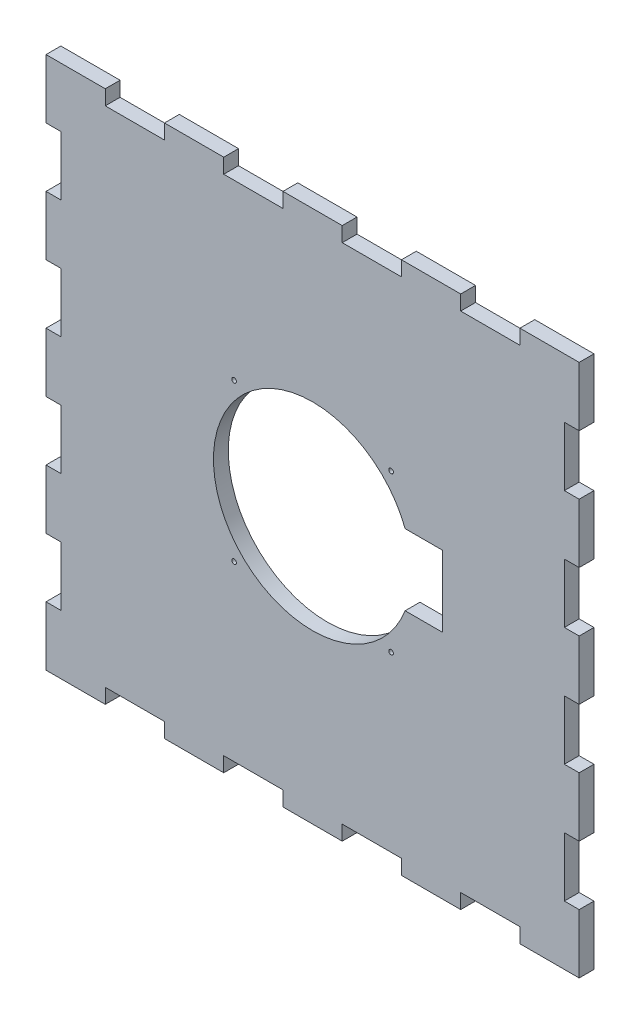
ISO-10303-21;
HEADER;
FILE_DESCRIPTION(('STEP AP214'),'2;1');
FILE_NAME('part.step','',(''),(''),'','','');
FILE_SCHEMA(('AUTOMOTIVE_DESIGN { 1 0 10303 214 1 1 1 1 }'));
ENDSEC;
DATA;
#1=APPLICATION_CONTEXT('core data for automotive mechanical design processes');
#2=APPLICATION_PROTOCOL_DEFINITION('international standard','automotive_design',2000,#1);
#3=PRODUCT_CONTEXT('',#1,'mechanical');
#4=PRODUCT('Part','Part','',(#3));
#5=PRODUCT_RELATED_PRODUCT_CATEGORY('part','',(#4));
#6=PRODUCT_DEFINITION_FORMATION('','',#4);
#7=PRODUCT_DEFINITION_CONTEXT('part definition',#1,'design');
#8=PRODUCT_DEFINITION('design','',#6,#7);
#9=PRODUCT_DEFINITION_SHAPE('','',#8);
#10=(LENGTH_UNIT() NAMED_UNIT(*) SI_UNIT(.MILLI.,.METRE.));
#11=(NAMED_UNIT(*) PLANE_ANGLE_UNIT() SI_UNIT($,.RADIAN.));
#12=(NAMED_UNIT(*) SI_UNIT($,.STERADIAN.) SOLID_ANGLE_UNIT());
#13=UNCERTAINTY_MEASURE_WITH_UNIT(LENGTH_MEASURE(1.E-05),#10,'distance_accuracy_value','');
#14=(GEOMETRIC_REPRESENTATION_CONTEXT(3) GLOBAL_UNCERTAINTY_ASSIGNED_CONTEXT((#13)) GLOBAL_UNIT_ASSIGNED_CONTEXT((#10,
#11,#12)) REPRESENTATION_CONTEXT('',''));
#15=CARTESIAN_POINT('',(0.,0.,0.));
#16=DIRECTION('',(0.,0.,1.));
#17=DIRECTION('',(1.,0.,0.));
#18=AXIS2_PLACEMENT_3D('',#15,#16,#17);
#19=CARTESIAN_POINT('',(0.,0.,-3.175));
#20=DIRECTION('',(0.,0.,1.));
#21=DIRECTION('',(1.,0.,0.));
#22=AXIS2_PLACEMENT_3D('',#19,#20,#21);
#23=PLANE('',#22);
#24=DIRECTION('',(1.,0.,0.));
#25=VECTOR('',#24,1.);
#26=CARTESIAN_POINT('',(0.,44.45,-3.175));
#27=LINE('',#26,#25);
#28=CARTESIAN_POINT('',(53.975,44.45,-3.175));
#29=VERTEX_POINT('',#28);
#30=CARTESIAN_POINT('',(57.15,44.45,-3.175));
#31=VERTEX_POINT('',#30);
#32=EDGE_CURVE('E564',#29,#31,#27,.T.);
#33=ORIENTED_EDGE('',*,*,#32,.F.);
#34=DIRECTION('',(0.,-1.,0.));
#35=VECTOR('',#34,1.);
#36=CARTESIAN_POINT('',(53.975,0.,-3.175));
#37=LINE('',#36,#35);
#38=CARTESIAN_POINT('',(53.975,31.75,-3.175));
#39=VERTEX_POINT('',#38);
#40=EDGE_CURVE('E655',#29,#39,#37,.T.);
#41=ORIENTED_EDGE('',*,*,#40,.T.);
#42=DIRECTION('',(-1.,0.,0.));
#43=VECTOR('',#42,1.);
#44=CARTESIAN_POINT('',(0.,31.75,-3.175));
#45=LINE('',#44,#43);
#46=CARTESIAN_POINT('',(57.15,31.75,-3.175));
#47=VERTEX_POINT('',#46);
#48=EDGE_CURVE('E659',#47,#39,#45,.T.);
#49=ORIENTED_EDGE('',*,*,#48,.F.);
#50=DIRECTION('',(0.,1.,0.));
#51=VECTOR('',#50,1.);
#52=CARTESIAN_POINT('',(57.15,0.,-3.175));
#53=LINE('',#52,#51);
#54=CARTESIAN_POINT('',(57.1500000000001,19.05,-3.175));
#55=VERTEX_POINT('',#54);
#56=EDGE_CURVE('E1304',#55,#47,#53,.T.);
#57=ORIENTED_EDGE('',*,*,#56,.F.);
#58=DIRECTION('',(-1.,0.,0.));
#59=VECTOR('',#58,1.);
#60=CARTESIAN_POINT('',(0.,19.05,-3.175));
#61=LINE('',#60,#59);
#62=CARTESIAN_POINT('',(53.9750000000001,19.05,-3.175));
#63=VERTEX_POINT('',#62);
#64=EDGE_CURVE('E548',#55,#63,#61,.T.);
#65=ORIENTED_EDGE('',*,*,#64,.T.);
#66=DIRECTION('',(0.,-1.,0.));
#67=VECTOR('',#66,1.);
#68=CARTESIAN_POINT('',(53.9750000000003,0.,-3.175));
#69=LINE('',#68,#67);
#70=CARTESIAN_POINT('',(53.9750000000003,6.35000000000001,-3.175));
#71=VERTEX_POINT('',#70);
#72=EDGE_CURVE('E552',#63,#71,#69,.T.);
#73=ORIENTED_EDGE('',*,*,#72,.T.);
#74=DIRECTION('',(-1.,0.,0.));
#75=VECTOR('',#74,1.);
#76=CARTESIAN_POINT('',(0.,6.35000000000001,-3.175));
#77=LINE('',#76,#75);
#78=CARTESIAN_POINT('',(57.1500000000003,6.35000000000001,-3.175));
#79=VERTEX_POINT('',#78);
#80=EDGE_CURVE('E557',#79,#71,#77,.T.);
#81=ORIENTED_EDGE('',*,*,#80,.F.);
#82=CARTESIAN_POINT('',(57.1500000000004,-6.34999999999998,-3.175));
#83=VERTEX_POINT('',#82);
#84=EDGE_CURVE('E1309',#83,#79,#53,.T.);
#85=ORIENTED_EDGE('',*,*,#84,.F.);
#86=DIRECTION('',(-1.,0.,0.));
#87=VECTOR('',#86,1.);
#88=CARTESIAN_POINT('',(0.,-6.34999999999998,-3.175));
#89=LINE('',#88,#87);
#90=CARTESIAN_POINT('',(53.9750000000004,-6.34999999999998,-3.175));
#91=VERTEX_POINT('',#90);
#92=EDGE_CURVE('E576',#83,#91,#89,.T.);
#93=ORIENTED_EDGE('',*,*,#92,.T.);
#94=DIRECTION('',(0.,-1.,0.));
#95=VECTOR('',#94,1.);
#96=CARTESIAN_POINT('',(53.9750000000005,0.,-3.175));
#97=LINE('',#96,#95);
#98=CARTESIAN_POINT('',(53.9750000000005,-19.05,-3.175));
#99=VERTEX_POINT('',#98);
#100=EDGE_CURVE('E580',#91,#99,#97,.T.);
#101=ORIENTED_EDGE('',*,*,#100,.T.);
#102=DIRECTION('',(-1.,0.,0.));
#103=VECTOR('',#102,1.);
#104=CARTESIAN_POINT('',(0.,-19.05,-3.175));
#105=LINE('',#104,#103);
#106=CARTESIAN_POINT('',(57.1500000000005,-19.05,-3.175));
#107=VERTEX_POINT('',#106);
#108=EDGE_CURVE('E585',#107,#99,#105,.T.);
#109=ORIENTED_EDGE('',*,*,#108,.F.);
#110=CARTESIAN_POINT('',(57.1500000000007,-31.75,-3.175));
#111=VERTEX_POINT('',#110);
#112=EDGE_CURVE('E1091',#111,#107,#53,.T.);
#113=ORIENTED_EDGE('',*,*,#112,.F.);
#114=DIRECTION('',(-1.,0.,0.));
#115=VECTOR('',#114,1.);
#116=CARTESIAN_POINT('',(0.,-31.75,-3.175));
#117=LINE('',#116,#115);
#118=CARTESIAN_POINT('',(53.9750000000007,-31.75,-3.175));
#119=VERTEX_POINT('',#118);
#120=EDGE_CURVE('E547',#111,#119,#117,.T.);
#121=ORIENTED_EDGE('',*,*,#120,.T.);
#122=DIRECTION('',(0.,-1.,0.));
#123=VECTOR('',#122,1.);
#124=CARTESIAN_POINT('',(53.9750000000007,0.,-3.175));
#125=LINE('',#124,#123);
#126=CARTESIAN_POINT('',(53.9750000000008,-44.45,-3.175));
#127=VERTEX_POINT('',#126);
#128=EDGE_CURVE('E605',#119,#127,#125,.T.);
#129=ORIENTED_EDGE('',*,*,#128,.T.);
#130=DIRECTION('',(-1.,0.,0.));
#131=VECTOR('',#130,1.);
#132=CARTESIAN_POINT('',(0.,-44.45,-3.175));
#133=LINE('',#132,#131);
#134=CARTESIAN_POINT('',(57.1500000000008,-44.45,-3.175));
#135=VERTEX_POINT('',#134);
#136=EDGE_CURVE('E609',#135,#127,#133,.T.);
#137=ORIENTED_EDGE('',*,*,#136,.F.);
#138=CARTESIAN_POINT('',(57.15,-57.15,-3.175));
#139=VERTEX_POINT('',#138);
#140=EDGE_CURVE('E1086',#139,#135,#53,.T.);
#141=ORIENTED_EDGE('',*,*,#140,.F.);
#142=DIRECTION('',(1.,0.,0.));
#143=VECTOR('',#142,1.);
#144=CARTESIAN_POINT('',(0.,-57.15,-3.175));
#145=LINE('',#144,#143);
#146=CARTESIAN_POINT('',(44.45,-57.15,-3.175));
#147=VERTEX_POINT('',#146);
#148=EDGE_CURVE('E1079',#147,#139,#145,.T.);
#149=ORIENTED_EDGE('',*,*,#148,.F.);
#150=DIRECTION('',(0.,-1.,0.));
#151=VECTOR('',#150,1.);
#152=CARTESIAN_POINT('',(44.45,-53.975,-3.175));
#153=LINE('',#152,#151);
#154=CARTESIAN_POINT('',(44.45,-53.975,-3.175));
#155=VERTEX_POINT('',#154);
#156=EDGE_CURVE('E1053',#155,#147,#153,.T.);
#157=ORIENTED_EDGE('',*,*,#156,.F.);
#158=DIRECTION('',(1.,0.,0.));
#159=VECTOR('',#158,1.);
#160=CARTESIAN_POINT('',(0.,-53.975,-3.175));
#161=LINE('',#160,#159);
#162=CARTESIAN_POINT('',(31.75,-53.975,-3.175));
#163=VERTEX_POINT('',#162);
#164=EDGE_CURVE('E1040',#163,#155,#161,.T.);
#165=ORIENTED_EDGE('',*,*,#164,.F.);
#166=DIRECTION('',(0.,-1.,0.));
#167=VECTOR('',#166,1.);
#168=CARTESIAN_POINT('',(31.75,-53.975,-3.175));
#169=LINE('',#168,#167);
#170=CARTESIAN_POINT('',(31.75,-57.15,-3.175));
#171=VERTEX_POINT('',#170);
#172=EDGE_CURVE('E1044',#163,#171,#169,.T.);
#173=ORIENTED_EDGE('',*,*,#172,.T.);
#174=CARTESIAN_POINT('',(19.05,-57.15,-3.175));
#175=VERTEX_POINT('',#174);
#176=EDGE_CURVE('E1468',#175,#171,#145,.T.);
#177=ORIENTED_EDGE('',*,*,#176,.F.);
#178=DIRECTION('',(0.,-1.,0.));
#179=VECTOR('',#178,1.);
#180=CARTESIAN_POINT('',(19.05,-53.975,-3.175));
#181=LINE('',#180,#179);
#182=CARTESIAN_POINT('',(19.05,-53.975,-3.175));
#183=VERTEX_POINT('',#182);
#184=EDGE_CURVE('E1020',#183,#175,#181,.T.);
#185=ORIENTED_EDGE('',*,*,#184,.F.);
#186=DIRECTION('',(1.,0.,0.));
#187=VECTOR('',#186,1.);
#188=CARTESIAN_POINT('',(0.,-53.975,-3.175));
#189=LINE('',#188,#187);
#190=CARTESIAN_POINT('',(6.34999999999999,-53.975,-3.175));
#191=VERTEX_POINT('',#190);
#192=EDGE_CURVE('E1005',#191,#183,#189,.T.);
#193=ORIENTED_EDGE('',*,*,#192,.F.);
#194=DIRECTION('',(0.,-1.,0.));
#195=VECTOR('',#194,1.);
#196=CARTESIAN_POINT('',(6.34999999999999,-53.975,-3.175));
#197=LINE('',#196,#195);
#198=CARTESIAN_POINT('',(6.34999999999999,-57.15,-3.175));
#199=VERTEX_POINT('',#198);
#200=EDGE_CURVE('E1009',#191,#199,#197,.T.);
#201=ORIENTED_EDGE('',*,*,#200,.T.);
#202=CARTESIAN_POINT('',(-6.35000000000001,-57.15,-3.175));
#203=VERTEX_POINT('',#202);
#204=EDGE_CURVE('E1472',#203,#199,#145,.T.);
#205=ORIENTED_EDGE('',*,*,#204,.F.);
#206=DIRECTION('',(0.,-1.,0.));
#207=VECTOR('',#206,1.);
#208=CARTESIAN_POINT('',(-6.35000000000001,-53.975,-3.175));
#209=LINE('',#208,#207);
#210=CARTESIAN_POINT('',(-6.35000000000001,-53.975,-3.175));
#211=VERTEX_POINT('',#210);
#212=EDGE_CURVE('E985',#211,#203,#209,.T.);
#213=ORIENTED_EDGE('',*,*,#212,.F.);
#214=DIRECTION('',(1.,0.,0.));
#215=VECTOR('',#214,1.);
#216=CARTESIAN_POINT('',(0.,-53.975,-3.175));
#217=LINE('',#216,#215);
#218=CARTESIAN_POINT('',(-19.05,-53.975,-3.175));
#219=VERTEX_POINT('',#218);
#220=EDGE_CURVE('E970',#219,#211,#217,.T.);
#221=ORIENTED_EDGE('',*,*,#220,.F.);
#222=DIRECTION('',(0.,-1.,0.));
#223=VECTOR('',#222,1.);
#224=CARTESIAN_POINT('',(-19.05,-53.975,-3.175));
#225=LINE('',#224,#223);
#226=CARTESIAN_POINT('',(-19.05,-57.15,-3.175));
#227=VERTEX_POINT('',#226);
#228=EDGE_CURVE('E974',#219,#227,#225,.T.);
#229=ORIENTED_EDGE('',*,*,#228,.T.);
#230=CARTESIAN_POINT('',(-31.75,-57.15,-3.175));
#231=VERTEX_POINT('',#230);
#232=EDGE_CURVE('E1085',#231,#227,#145,.T.);
#233=ORIENTED_EDGE('',*,*,#232,.F.);
#234=DIRECTION('',(0.,-1.,0.));
#235=VECTOR('',#234,1.);
#236=CARTESIAN_POINT('',(-31.75,-53.975,-3.175));
#237=LINE('',#236,#235);
#238=CARTESIAN_POINT('',(-31.75,-53.975,-3.175));
#239=VERTEX_POINT('',#238);
#240=EDGE_CURVE('E950',#239,#231,#237,.T.);
#241=ORIENTED_EDGE('',*,*,#240,.F.);
#242=DIRECTION('',(1.,0.,0.));
#243=VECTOR('',#242,1.);
#244=CARTESIAN_POINT('',(0.,-53.975,-3.175));
#245=LINE('',#244,#243);
#246=CARTESIAN_POINT('',(-44.45,-53.975,-3.175));
#247=VERTEX_POINT('',#246);
#248=EDGE_CURVE('E931',#247,#239,#245,.T.);
#249=ORIENTED_EDGE('',*,*,#248,.F.);
#250=DIRECTION('',(0.,-1.,0.));
#251=VECTOR('',#250,1.);
#252=CARTESIAN_POINT('',(-44.45,-53.975,-3.175));
#253=LINE('',#252,#251);
#254=CARTESIAN_POINT('',(-44.45,-57.15,-3.175));
#255=VERTEX_POINT('',#254);
#256=EDGE_CURVE('E953',#247,#255,#253,.T.);
#257=ORIENTED_EDGE('',*,*,#256,.T.);
#258=CARTESIAN_POINT('',(-57.15,-57.15,-3.175));
#259=VERTEX_POINT('',#258);
#260=EDGE_CURVE('E1080',#259,#255,#145,.T.);
#261=ORIENTED_EDGE('',*,*,#260,.F.);
#262=DIRECTION('',(0.,1.,0.));
#263=VECTOR('',#262,1.);
#264=CARTESIAN_POINT('',(-57.15,0.,-3.175));
#265=LINE('',#264,#263);
#266=CARTESIAN_POINT('',(-57.1499999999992,-44.45,-3.175));
#267=VERTEX_POINT('',#266);
#268=EDGE_CURVE('E1098',#259,#267,#265,.T.);
#269=ORIENTED_EDGE('',*,*,#268,.T.);
#270=DIRECTION('',(-1.,0.,0.));
#271=VECTOR('',#270,1.);
#272=CARTESIAN_POINT('',(0.,-44.45,-3.175));
#273=LINE('',#272,#271);
#274=CARTESIAN_POINT('',(-53.9749999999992,-44.45,-3.175));
#275=VERTEX_POINT('',#274);
#276=EDGE_CURVE('E634',#275,#267,#273,.T.);
#277=ORIENTED_EDGE('',*,*,#276,.F.);
#278=DIRECTION('',(0.,-1.,0.));
#279=VECTOR('',#278,1.);
#280=CARTESIAN_POINT('',(-53.9749999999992,0.,-3.175));
#281=LINE('',#280,#279);
#282=CARTESIAN_POINT('',(-53.9749999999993,-31.75,-3.175));
#283=VERTEX_POINT('',#282);
#284=EDGE_CURVE('E626',#283,#275,#281,.T.);
#285=ORIENTED_EDGE('',*,*,#284,.F.);
#286=DIRECTION('',(-1.,0.,0.));
#287=VECTOR('',#286,1.);
#288=CARTESIAN_POINT('',(0.,-31.75,-3.175));
#289=LINE('',#288,#287);
#290=CARTESIAN_POINT('',(-57.1499999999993,-31.75,-3.175));
#291=VERTEX_POINT('',#290);
#292=EDGE_CURVE('E629',#283,#291,#289,.T.);
#293=ORIENTED_EDGE('',*,*,#292,.T.);
#294=CARTESIAN_POINT('',(-57.1499999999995,-19.05,-3.175));
#295=VERTEX_POINT('',#294);
#296=EDGE_CURVE('E1102',#291,#295,#265,.T.);
#297=ORIENTED_EDGE('',*,*,#296,.T.);
#298=DIRECTION('',(-1.,0.,0.));
#299=VECTOR('',#298,1.);
#300=CARTESIAN_POINT('',(0.,-19.05,-3.175));
#301=LINE('',#300,#299);
#302=CARTESIAN_POINT('',(-53.9749999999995,-19.05,-3.175));
#303=VERTEX_POINT('',#302);
#304=EDGE_CURVE('E709',#303,#295,#301,.T.);
#305=ORIENTED_EDGE('',*,*,#304,.F.);
#306=DIRECTION('',(0.,-1.,0.));
#307=VECTOR('',#306,1.);
#308=CARTESIAN_POINT('',(-53.9749999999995,0.,-3.175));
#309=LINE('',#308,#307);
#310=CARTESIAN_POINT('',(-53.9749999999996,-6.34999999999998,-3.175));
#311=VERTEX_POINT('',#310);
#312=EDGE_CURVE('E642',#311,#303,#309,.T.);
#313=ORIENTED_EDGE('',*,*,#312,.F.);
#314=DIRECTION('',(-1.,0.,0.));
#315=VECTOR('',#314,1.);
#316=CARTESIAN_POINT('',(0.,-6.34999999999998,-3.175));
#317=LINE('',#316,#315);
#318=CARTESIAN_POINT('',(-57.1499999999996,-6.34999999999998,-3.175));
#319=VERTEX_POINT('',#318);
#320=EDGE_CURVE('E705',#311,#319,#317,.T.);
#321=ORIENTED_EDGE('',*,*,#320,.T.);
#322=CARTESIAN_POINT('',(-57.1499999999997,6.35000000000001,-3.175));
#323=VERTEX_POINT('',#322);
#324=EDGE_CURVE('E1607',#319,#323,#265,.T.);
#325=ORIENTED_EDGE('',*,*,#324,.T.);
#326=DIRECTION('',(-1.,0.,0.));
#327=VECTOR('',#326,1.);
#328=CARTESIAN_POINT('',(0.,6.35000000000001,-3.175));
#329=LINE('',#328,#327);
#330=CARTESIAN_POINT('',(-53.9749999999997,6.35000000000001,-3.175));
#331=VERTEX_POINT('',#330);
#332=EDGE_CURVE('E684',#331,#323,#329,.T.);
#333=ORIENTED_EDGE('',*,*,#332,.F.);
#334=DIRECTION('',(0.,-1.,0.));
#335=VECTOR('',#334,1.);
#336=CARTESIAN_POINT('',(-53.9749999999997,0.,-3.175));
#337=LINE('',#336,#335);
#338=CARTESIAN_POINT('',(-53.9749999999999,19.05,-3.175));
#339=VERTEX_POINT('',#338);
#340=EDGE_CURVE('E676',#339,#331,#337,.T.);
#341=ORIENTED_EDGE('',*,*,#340,.F.);
#342=DIRECTION('',(-1.,0.,0.));
#343=VECTOR('',#342,1.);
#344=CARTESIAN_POINT('',(0.,19.05,-3.175));
#345=LINE('',#344,#343);
#346=CARTESIAN_POINT('',(-57.1499999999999,19.05,-3.175));
#347=VERTEX_POINT('',#346);
#348=EDGE_CURVE('E679',#339,#347,#345,.T.);
#349=ORIENTED_EDGE('',*,*,#348,.T.);
#350=CARTESIAN_POINT('',(-57.15,31.75,-3.175));
#351=VERTEX_POINT('',#350);
#352=EDGE_CURVE('E1603',#347,#351,#265,.T.);
#353=ORIENTED_EDGE('',*,*,#352,.T.);
#354=DIRECTION('',(-1.,0.,0.));
#355=VECTOR('',#354,1.);
#356=CARTESIAN_POINT('',(0.,31.75,-3.175));
#357=LINE('',#356,#355);
#358=CARTESIAN_POINT('',(-53.975,31.75,-3.175));
#359=VERTEX_POINT('',#358);
#360=EDGE_CURVE('E86',#359,#351,#357,.T.);
#361=ORIENTED_EDGE('',*,*,#360,.F.);
#362=DIRECTION('',(0.,-1.,0.));
#363=VECTOR('',#362,1.);
#364=CARTESIAN_POINT('',(-53.975,0.,-3.175));
#365=LINE('',#364,#363);
#366=CARTESIAN_POINT('',(-53.975,44.45,-3.175));
#367=VERTEX_POINT('',#366);
#368=EDGE_CURVE('E730',#367,#359,#365,.T.);
#369=ORIENTED_EDGE('',*,*,#368,.F.);
#370=DIRECTION('',(1.,0.,0.));
#371=VECTOR('',#370,1.);
#372=CARTESIAN_POINT('',(0.,44.45,-3.175));
#373=LINE('',#372,#371);
#374=CARTESIAN_POINT('',(-57.15,44.45,-3.175));
#375=VERTEX_POINT('',#374);
#376=EDGE_CURVE('E692',#375,#367,#373,.T.);
#377=ORIENTED_EDGE('',*,*,#376,.F.);
#378=CARTESIAN_POINT('',(-57.15,57.15,-3.175));
#379=VERTEX_POINT('',#378);
#380=EDGE_CURVE('E1096',#375,#379,#265,.T.);
#381=ORIENTED_EDGE('',*,*,#380,.T.);
#382=DIRECTION('',(1.,0.,0.));
#383=VECTOR('',#382,1.);
#384=CARTESIAN_POINT('',(0.,57.15,-3.175));
#385=LINE('',#384,#383);
#386=CARTESIAN_POINT('',(-44.45,57.15,-3.175));
#387=VERTEX_POINT('',#386);
#388=EDGE_CURVE('E1092',#379,#387,#385,.T.);
#389=ORIENTED_EDGE('',*,*,#388,.T.);
#390=DIRECTION('',(0.,-1.,0.));
#391=VECTOR('',#390,1.);
#392=CARTESIAN_POINT('',(-44.45,57.150012,-3.175));
#393=LINE('',#392,#391);
#394=CARTESIAN_POINT('',(-44.45,53.975,-3.175));
#395=VERTEX_POINT('',#394);
#396=EDGE_CURVE('E815',#387,#395,#393,.T.);
#397=ORIENTED_EDGE('',*,*,#396,.T.);
#398=DIRECTION('',(1.,0.,0.));
#399=VECTOR('',#398,1.);
#400=CARTESIAN_POINT('',(-44.45,53.975,-3.175));
#401=LINE('',#400,#399);
#402=CARTESIAN_POINT('',(-31.75,53.975,-3.175));
#403=VERTEX_POINT('',#402);
#404=EDGE_CURVE('E825',#395,#403,#401,.T.);
#405=ORIENTED_EDGE('',*,*,#404,.T.);
#406=DIRECTION('',(0.,-1.,0.));
#407=VECTOR('',#406,1.);
#408=CARTESIAN_POINT('',(-31.75,57.150012,-3.175));
#409=LINE('',#408,#407);
#410=CARTESIAN_POINT('',(-31.75,57.15,-3.175));
#411=VERTEX_POINT('',#410);
#412=EDGE_CURVE('E811',#411,#403,#409,.T.);
#413=ORIENTED_EDGE('',*,*,#412,.F.);
#414=CARTESIAN_POINT('',(-19.05,57.15,-3.175));
#415=VERTEX_POINT('',#414);
#416=EDGE_CURVE('E1097',#411,#415,#385,.T.);
#417=ORIENTED_EDGE('',*,*,#416,.T.);
#418=DIRECTION('',(0.,-1.,0.));
#419=VECTOR('',#418,1.);
#420=CARTESIAN_POINT('',(-19.05,57.150012,-3.175));
#421=LINE('',#420,#419);
#422=CARTESIAN_POINT('',(-19.05,53.975,-3.175));
#423=VERTEX_POINT('',#422);
#424=EDGE_CURVE('E846',#415,#423,#421,.T.);
#425=ORIENTED_EDGE('',*,*,#424,.T.);
#426=DIRECTION('',(-1.,0.,0.));
#427=VECTOR('',#426,1.);
#428=CARTESIAN_POINT('',(0.,53.975,-3.175));
#429=LINE('',#428,#427);
#430=CARTESIAN_POINT('',(-6.35000000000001,53.975,-3.175));
#431=VERTEX_POINT('',#430);
#432=EDGE_CURVE('E855',#431,#423,#429,.T.);
#433=ORIENTED_EDGE('',*,*,#432,.F.);
#434=DIRECTION('',(0.,-1.,0.));
#435=VECTOR('',#434,1.);
#436=CARTESIAN_POINT('',(-6.35000000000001,57.150012,-3.175));
#437=LINE('',#436,#435);
#438=CARTESIAN_POINT('',(-6.35000000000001,57.15,-3.175));
#439=VERTEX_POINT('',#438);
#440=EDGE_CURVE('E842',#439,#431,#437,.T.);
#441=ORIENTED_EDGE('',*,*,#440,.F.);
#442=CARTESIAN_POINT('',(6.34999999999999,57.15,-3.175));
#443=VERTEX_POINT('',#442);
#444=EDGE_CURVE('E1364',#439,#443,#385,.T.);
#445=ORIENTED_EDGE('',*,*,#444,.T.);
#446=DIRECTION('',(0.,1.,0.));
#447=VECTOR('',#446,1.);
#448=CARTESIAN_POINT('',(6.34999999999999,53.975,-3.175));
#449=LINE('',#448,#447);
#450=CARTESIAN_POINT('',(6.34999999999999,53.975,-3.175));
#451=VERTEX_POINT('',#450);
#452=EDGE_CURVE('E914',#451,#443,#449,.T.);
#453=ORIENTED_EDGE('',*,*,#452,.F.);
#454=DIRECTION('',(-1.,0.,0.));
#455=VECTOR('',#454,1.);
#456=CARTESIAN_POINT('',(0.,53.975,-3.175));
#457=LINE('',#456,#455);
#458=CARTESIAN_POINT('',(19.05,53.975,-3.175));
#459=VERTEX_POINT('',#458);
#460=EDGE_CURVE('E901',#459,#451,#457,.T.);
#461=ORIENTED_EDGE('',*,*,#460,.F.);
#462=DIRECTION('',(0.,1.,0.));
#463=VECTOR('',#462,1.);
#464=CARTESIAN_POINT('',(19.05,53.975,-3.175));
#465=LINE('',#464,#463);
#466=CARTESIAN_POINT('',(19.05,57.15,-3.175));
#467=VERTEX_POINT('',#466);
#468=EDGE_CURVE('E917',#459,#467,#465,.T.);
#469=ORIENTED_EDGE('',*,*,#468,.T.);
#470=CARTESIAN_POINT('',(31.75,57.15,-3.175));
#471=VERTEX_POINT('',#470);
#472=EDGE_CURVE('E1325',#467,#471,#385,.T.);
#473=ORIENTED_EDGE('',*,*,#472,.T.);
#474=DIRECTION('',(0.,-1.,0.));
#475=VECTOR('',#474,1.);
#476=CARTESIAN_POINT('',(31.75,57.150012,-3.175));
#477=LINE('',#476,#475);
#478=CARTESIAN_POINT('',(31.75,53.975,-3.175));
#479=VERTEX_POINT('',#478);
#480=EDGE_CURVE('E873',#471,#479,#477,.T.);
#481=ORIENTED_EDGE('',*,*,#480,.T.);
#482=DIRECTION('',(-1.,0.,0.));
#483=VECTOR('',#482,1.);
#484=CARTESIAN_POINT('',(0.,53.975,-3.175));
#485=LINE('',#484,#483);
#486=CARTESIAN_POINT('',(44.45,53.975,-3.175));
#487=VERTEX_POINT('',#486);
#488=EDGE_CURVE('E883',#487,#479,#485,.T.);
#489=ORIENTED_EDGE('',*,*,#488,.F.);
#490=DIRECTION('',(0.,-1.,0.));
#491=VECTOR('',#490,1.);
#492=CARTESIAN_POINT('',(44.45,57.150012,-3.175));
#493=LINE('',#492,#491);
#494=CARTESIAN_POINT('',(44.45,57.15,-3.175));
#495=VERTEX_POINT('',#494);
#496=EDGE_CURVE('E870',#495,#487,#493,.T.);
#497=ORIENTED_EDGE('',*,*,#496,.F.);
#498=CARTESIAN_POINT('',(57.15,57.15,-3.175));
#499=VERTEX_POINT('',#498);
#500=EDGE_CURVE('E1090',#495,#499,#385,.T.);
#501=ORIENTED_EDGE('',*,*,#500,.T.);
#502=EDGE_CURVE('E1084',#31,#499,#53,.T.);
#503=ORIENTED_EDGE('',*,*,#502,.F.);
#504=EDGE_LOOP('',(#33,#41,#49,#57,#65,#73,#81,#85,#93,#101,#109,#113,#121,#129,#137,#141,#149,
#157,#165,#173,#177,#185,#193,#201,#205,#213,#221,#229,#233,#241,#249,#257,#261,#269,#277,#285,
#293,#297,#305,#313,#321,#325,#333,#341,#349,#353,#361,#369,#377,#381,#389,#397,#405,#413,#417,
#425,#433,#441,#445,#453,#461,#469,#473,#481,#489,#497,#501,#503));
#505=FACE_BOUND('',#504,.T.);
#506=CARTESIAN_POINT('',(-16.8291413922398,16.8291413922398,-3.175));
#507=DIRECTION('',(0.,0.,1.));
#508=DIRECTION('',(1.,0.,0.));
#509=AXIS2_PLACEMENT_3D('',#506,#507,#508);
#510=CIRCLE('',#509,0.499999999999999);
#511=CARTESIAN_POINT('',(-16.3291413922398,16.8291413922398,-3.175));
#512=VERTEX_POINT('',#511);
#513=EDGE_CURVE('E1075',#512,#512,#510,.T.);
#514=ORIENTED_EDGE('',*,*,#513,.T.);
#515=EDGE_LOOP('',(#514));
#516=FACE_BOUND('',#515,.T.);
#517=CARTESIAN_POINT('',(-16.8291413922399,-16.8291413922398,-3.175));
#518=DIRECTION('',(0.,0.,1.));
#519=DIRECTION('',(1.,0.,0.));
#520=AXIS2_PLACEMENT_3D('',#517,#518,#519);
#521=CIRCLE('',#520,0.499999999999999);
#522=CARTESIAN_POINT('',(-16.3291413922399,-16.8291413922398,-3.175));
#523=VERTEX_POINT('',#522);
#524=EDGE_CURVE('E1071',#523,#523,#521,.T.);
#525=ORIENTED_EDGE('',*,*,#524,.T.);
#526=EDGE_LOOP('',(#525));
#527=FACE_BOUND('',#526,.T.);
#528=CARTESIAN_POINT('',(16.8291413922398,-16.8291413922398,-3.175));
#529=DIRECTION('',(0.,0.,1.));
#530=DIRECTION('',(1.,0.,0.));
#531=AXIS2_PLACEMENT_3D('',#528,#529,#530);
#532=CIRCLE('',#531,0.499999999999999);
#533=CARTESIAN_POINT('',(17.3291413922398,-16.8291413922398,-3.175));
#534=VERTEX_POINT('',#533);
#535=EDGE_CURVE('E1066',#534,#534,#532,.F.);
#536=ORIENTED_EDGE('',*,*,#535,.F.);
#537=EDGE_LOOP('',(#536));
#538=FACE_BOUND('',#537,.T.);
#539=CARTESIAN_POINT('',(16.8291413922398,16.8291413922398,-3.175));
#540=DIRECTION('',(0.,0.,1.));
#541=DIRECTION('',(1.,0.,0.));
#542=AXIS2_PLACEMENT_3D('',#539,#540,#541);
#543=CIRCLE('',#542,0.499999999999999);
#544=CARTESIAN_POINT('',(17.3291413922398,16.8291413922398,-3.175));
#545=VERTEX_POINT('',#544);
#546=EDGE_CURVE('E1062',#545,#545,#543,.F.);
#547=ORIENTED_EDGE('',*,*,#546,.F.);
#548=EDGE_LOOP('',(#547));
#549=FACE_BOUND('',#548,.T.);
#550=DIRECTION('',(1.,0.,0.));
#551=VECTOR('',#550,1.);
#552=CARTESIAN_POINT('',(0.,7.62,-3.175));
#553=LINE('',#552,#551);
#554=CARTESIAN_POINT('',(19.8367865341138,7.62,-3.175));
#555=VERTEX_POINT('',#554);
#556=CARTESIAN_POINT('',(27.85,7.62,-3.175));
#557=VERTEX_POINT('',#556);
#558=EDGE_CURVE('E519',#555,#557,#553,.T.);
#559=ORIENTED_EDGE('',*,*,#558,.F.);
#560=CARTESIAN_POINT('',(0.,0.,-3.175));
#561=DIRECTION('',(0.,0.,1.));
#562=DIRECTION('',(1.,0.,0.));
#563=AXIS2_PLACEMENT_3D('',#560,#561,#562);
#564=CIRCLE('',#563,21.25);
#565=CARTESIAN_POINT('',(19.8367865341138,-7.62,-3.175));
#566=VERTEX_POINT('',#565);
#567=EDGE_CURVE('E532',#555,#566,#564,.T.);
#568=ORIENTED_EDGE('',*,*,#567,.T.);
#569=DIRECTION('',(1.,0.,0.));
#570=VECTOR('',#569,1.);
#571=CARTESIAN_POINT('',(0.,-7.62,-3.175));
#572=LINE('',#571,#570);
#573=CARTESIAN_POINT('',(27.85,-7.62,-3.175));
#574=VERTEX_POINT('',#573);
#575=EDGE_CURVE('E78',#566,#574,#572,.T.);
#576=ORIENTED_EDGE('',*,*,#575,.T.);
#577=DIRECTION('',(0.,1.,0.));
#578=VECTOR('',#577,1.);
#579=CARTESIAN_POINT('',(27.85,0.,-3.175));
#580=LINE('',#579,#578);
#581=EDGE_CURVE('E523',#574,#557,#580,.T.);
#582=ORIENTED_EDGE('',*,*,#581,.T.);
#583=EDGE_LOOP('',(#559,#568,#576,#582));
#584=FACE_BOUND('',#583,.T.);
#585=ADVANCED_FACE('F62',(#505,#516,#527,#538,#549,#584),#23,.F.);
#586=CARTESIAN_POINT('',(0.,0.,0.));
#587=DIRECTION('',(0.,0.,1.));
#588=DIRECTION('',(1.,0.,0.));
#589=AXIS2_PLACEMENT_3D('',#586,#587,#588);
#590=PLANE('',#589);
#591=CARTESIAN_POINT('',(16.8291413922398,16.8291413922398,0.));
#592=DIRECTION('',(0.,0.,1.));
#593=DIRECTION('',(1.,0.,0.));
#594=AXIS2_PLACEMENT_3D('',#591,#592,#593);
#595=CIRCLE('',#594,0.499999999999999);
#596=CARTESIAN_POINT('',(17.3291413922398,16.8291413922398,0.));
#597=VERTEX_POINT('',#596);
#598=EDGE_CURVE('E949',#597,#597,#595,.F.);
#599=ORIENTED_EDGE('',*,*,#598,.T.);
#600=EDGE_LOOP('',(#599));
#601=FACE_BOUND('',#600,.T.);
#602=CARTESIAN_POINT('',(16.8291413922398,-16.8291413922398,0.));
#603=DIRECTION('',(0.,0.,1.));
#604=DIRECTION('',(1.,0.,0.));
#605=AXIS2_PLACEMENT_3D('',#602,#603,#604);
#606=CIRCLE('',#605,0.499999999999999);
#607=CARTESIAN_POINT('',(17.3291413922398,-16.8291413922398,0.));
#608=VERTEX_POINT('',#607);
#609=EDGE_CURVE('E1109',#608,#608,#606,.F.);
#610=ORIENTED_EDGE('',*,*,#609,.T.);
#611=EDGE_LOOP('',(#610));
#612=FACE_BOUND('',#611,.T.);
#613=CARTESIAN_POINT('',(-16.8291413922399,-16.8291413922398,0.));
#614=DIRECTION('',(0.,0.,1.));
#615=DIRECTION('',(1.,0.,0.));
#616=AXIS2_PLACEMENT_3D('',#613,#614,#615);
#617=CIRCLE('',#616,0.499999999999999);
#618=CARTESIAN_POINT('',(-16.3291413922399,-16.8291413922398,0.));
#619=VERTEX_POINT('',#618);
#620=EDGE_CURVE('E1113',#619,#619,#617,.T.);
#621=ORIENTED_EDGE('',*,*,#620,.F.);
#622=EDGE_LOOP('',(#621));
#623=FACE_BOUND('',#622,.T.);
#624=CARTESIAN_POINT('',(-16.8291413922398,16.8291413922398,0.));
#625=DIRECTION('',(0.,0.,1.));
#626=DIRECTION('',(1.,0.,0.));
#627=AXIS2_PLACEMENT_3D('',#624,#625,#626);
#628=CIRCLE('',#627,0.499999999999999);
#629=CARTESIAN_POINT('',(-16.3291413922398,16.8291413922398,0.));
#630=VERTEX_POINT('',#629);
#631=EDGE_CURVE('E1117',#630,#630,#628,.T.);
#632=ORIENTED_EDGE('',*,*,#631,.F.);
#633=EDGE_LOOP('',(#632));
#634=FACE_BOUND('',#633,.T.);
#635=DIRECTION('',(0.,-1.,0.));
#636=VECTOR('',#635,1.);
#637=CARTESIAN_POINT('',(53.975,0.,0.));
#638=LINE('',#637,#636);
#639=CARTESIAN_POINT('',(53.975,44.45,0.));
#640=VERTEX_POINT('',#639);
#641=CARTESIAN_POINT('',(53.975,31.75,0.));
#642=VERTEX_POINT('',#641);
#643=EDGE_CURVE('E1215',#640,#642,#638,.T.);
#644=ORIENTED_EDGE('',*,*,#643,.F.);
#645=DIRECTION('',(1.,0.,0.));
#646=VECTOR('',#645,1.);
#647=CARTESIAN_POINT('',(0.,44.45,0.));
#648=LINE('',#647,#646);
#649=CARTESIAN_POINT('',(57.15,44.45,0.));
#650=VERTEX_POINT('',#649);
#651=EDGE_CURVE('E773',#640,#650,#648,.T.);
#652=ORIENTED_EDGE('',*,*,#651,.T.);
#653=DIRECTION('',(0.,1.,0.));
#654=VECTOR('',#653,1.);
#655=CARTESIAN_POINT('',(57.15,0.,0.));
#656=LINE('',#655,#654);
#657=CARTESIAN_POINT('',(57.15,57.15,0.));
#658=VERTEX_POINT('',#657);
#659=EDGE_CURVE('E1126',#650,#658,#656,.T.);
#660=ORIENTED_EDGE('',*,*,#659,.T.);
#661=DIRECTION('',(1.,0.,0.));
#662=VECTOR('',#661,1.);
#663=CARTESIAN_POINT('',(0.,57.15,0.));
#664=LINE('',#663,#662);
#665=CARTESIAN_POINT('',(44.45,57.15,0.));
#666=VERTEX_POINT('',#665);
#667=EDGE_CURVE('E1132',#666,#658,#664,.T.);
#668=ORIENTED_EDGE('',*,*,#667,.F.);
#669=DIRECTION('',(0.,-1.,0.));
#670=VECTOR('',#669,1.);
#671=CARTESIAN_POINT('',(44.45,57.150012,0.));
#672=LINE('',#671,#670);
#673=CARTESIAN_POINT('',(44.45,53.975,0.));
#674=VERTEX_POINT('',#673);
#675=EDGE_CURVE('E806',#666,#674,#672,.T.);
#676=ORIENTED_EDGE('',*,*,#675,.T.);
#677=DIRECTION('',(1.,0.,0.));
#678=VECTOR('',#677,1.);
#679=CARTESIAN_POINT('',(0.,53.975,0.));
#680=LINE('',#679,#678);
#681=CARTESIAN_POINT('',(31.75,53.975,0.));
#682=VERTEX_POINT('',#681);
#683=EDGE_CURVE('E856',#682,#674,#680,.T.);
#684=ORIENTED_EDGE('',*,*,#683,.F.);
#685=DIRECTION('',(0.,-1.,0.));
#686=VECTOR('',#685,1.);
#687=CARTESIAN_POINT('',(31.75,57.150012,0.));
#688=LINE('',#687,#686);
#689=CARTESIAN_POINT('',(31.75,57.15,0.));
#690=VERTEX_POINT('',#689);
#691=EDGE_CURVE('E877',#690,#682,#688,.T.);
#692=ORIENTED_EDGE('',*,*,#691,.F.);
#693=CARTESIAN_POINT('',(19.05,57.15,0.));
#694=VERTEX_POINT('',#693);
#695=EDGE_CURVE('E1329',#694,#690,#664,.T.);
#696=ORIENTED_EDGE('',*,*,#695,.F.);
#697=DIRECTION('',(0.,1.,0.));
#698=VECTOR('',#697,1.);
#699=CARTESIAN_POINT('',(19.05,53.975,0.));
#700=LINE('',#699,#698);
#701=CARTESIAN_POINT('',(19.05,53.975,0.));
#702=VERTEX_POINT('',#701);
#703=EDGE_CURVE('E908',#702,#694,#700,.T.);
#704=ORIENTED_EDGE('',*,*,#703,.F.);
#705=DIRECTION('',(1.,0.,0.));
#706=VECTOR('',#705,1.);
#707=CARTESIAN_POINT('',(0.,53.975,0.));
#708=LINE('',#707,#706);
#709=CARTESIAN_POINT('',(6.34999999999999,53.975,0.));
#710=VERTEX_POINT('',#709);
#711=EDGE_CURVE('E837',#710,#702,#708,.T.);
#712=ORIENTED_EDGE('',*,*,#711,.F.);
#713=DIRECTION('',(0.,1.,0.));
#714=VECTOR('',#713,1.);
#715=CARTESIAN_POINT('',(6.34999999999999,53.975,0.));
#716=LINE('',#715,#714);
#717=CARTESIAN_POINT('',(6.34999999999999,57.15,0.));
#718=VERTEX_POINT('',#717);
#719=EDGE_CURVE('E909',#710,#718,#716,.T.);
#720=ORIENTED_EDGE('',*,*,#719,.T.);
#721=CARTESIAN_POINT('',(-6.35000000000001,57.15,0.));
#722=VERTEX_POINT('',#721);
#723=EDGE_CURVE('E1333',#722,#718,#664,.T.);
#724=ORIENTED_EDGE('',*,*,#723,.F.);
#725=DIRECTION('',(0.,-1.,0.));
#726=VECTOR('',#725,1.);
#727=CARTESIAN_POINT('',(-6.35000000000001,57.150012,0.));
#728=LINE('',#727,#726);
#729=CARTESIAN_POINT('',(-6.35000000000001,53.975,0.));
#730=VERTEX_POINT('',#729);
#731=EDGE_CURVE('E838',#722,#730,#728,.T.);
#732=ORIENTED_EDGE('',*,*,#731,.T.);
#733=DIRECTION('',(1.,0.,0.));
#734=VECTOR('',#733,1.);
#735=CARTESIAN_POINT('',(0.,53.975,0.));
#736=LINE('',#735,#734);
#737=CARTESIAN_POINT('',(-19.05,53.975,0.));
#738=VERTEX_POINT('',#737);
#739=EDGE_CURVE('E843',#738,#730,#736,.T.);
#740=ORIENTED_EDGE('',*,*,#739,.F.);
#741=DIRECTION('',(0.,-1.,0.));
#742=VECTOR('',#741,1.);
#743=CARTESIAN_POINT('',(-19.05,57.150012,0.));
#744=LINE('',#743,#742);
#745=CARTESIAN_POINT('',(-19.05,57.15,0.));
#746=VERTEX_POINT('',#745);
#747=EDGE_CURVE('E812',#746,#738,#744,.T.);
#748=ORIENTED_EDGE('',*,*,#747,.F.);
#749=CARTESIAN_POINT('',(-31.75,57.15,0.));
#750=VERTEX_POINT('',#749);
#751=EDGE_CURVE('E1139',#750,#746,#664,.T.);
#752=ORIENTED_EDGE('',*,*,#751,.F.);
#753=DIRECTION('',(0.,-1.,0.));
#754=VECTOR('',#753,1.);
#755=CARTESIAN_POINT('',(-31.75,57.150012,0.));
#756=LINE('',#755,#754);
#757=CARTESIAN_POINT('',(-31.75,53.975,0.));
#758=VERTEX_POINT('',#757);
#759=EDGE_CURVE('E807',#750,#758,#756,.T.);
#760=ORIENTED_EDGE('',*,*,#759,.T.);
#761=DIRECTION('',(1.,0.,0.));
#762=VECTOR('',#761,1.);
#763=CARTESIAN_POINT('',(-44.45,53.975,0.));
#764=LINE('',#763,#762);
#765=CARTESIAN_POINT('',(-44.45,53.975,0.));
#766=VERTEX_POINT('',#765);
#767=EDGE_CURVE('E833',#766,#758,#764,.T.);
#768=ORIENTED_EDGE('',*,*,#767,.F.);
#769=DIRECTION('',(0.,-1.,0.));
#770=VECTOR('',#769,1.);
#771=CARTESIAN_POINT('',(-44.45,57.150012,0.));
#772=LINE('',#771,#770);
#773=CARTESIAN_POINT('',(-44.45,57.15,0.));
#774=VERTEX_POINT('',#773);
#775=EDGE_CURVE('E819',#774,#766,#772,.T.);
#776=ORIENTED_EDGE('',*,*,#775,.F.);
#777=CARTESIAN_POINT('',(-57.15,57.15,0.));
#778=VERTEX_POINT('',#777);
#779=EDGE_CURVE('E1134',#778,#774,#664,.T.);
#780=ORIENTED_EDGE('',*,*,#779,.F.);
#781=DIRECTION('',(0.,1.,0.));
#782=VECTOR('',#781,1.);
#783=CARTESIAN_POINT('',(-57.15,0.,0.));
#784=LINE('',#783,#782);
#785=CARTESIAN_POINT('',(-57.15,44.45,0.));
#786=VERTEX_POINT('',#785);
#787=EDGE_CURVE('E1138',#786,#778,#784,.T.);
#788=ORIENTED_EDGE('',*,*,#787,.F.);
#789=DIRECTION('',(1.,0.,0.));
#790=VECTOR('',#789,1.);
#791=CARTESIAN_POINT('',(0.,44.45,0.));
#792=LINE('',#791,#790);
#793=CARTESIAN_POINT('',(-53.975,44.45,0.));
#794=VERTEX_POINT('',#793);
#795=EDGE_CURVE('E781',#786,#794,#792,.T.);
#796=ORIENTED_EDGE('',*,*,#795,.T.);
#797=DIRECTION('',(0.,-1.,0.));
#798=VECTOR('',#797,1.);
#799=CARTESIAN_POINT('',(-53.975,0.,0.));
#800=LINE('',#799,#798);
#801=CARTESIAN_POINT('',(-53.975,31.75,0.));
#802=VERTEX_POINT('',#801);
#803=EDGE_CURVE('E1190',#794,#802,#800,.T.);
#804=ORIENTED_EDGE('',*,*,#803,.T.);
#805=DIRECTION('',(-1.,0.,0.));
#806=VECTOR('',#805,1.);
#807=CARTESIAN_POINT('',(0.,31.75,0.));
#808=LINE('',#807,#806);
#809=CARTESIAN_POINT('',(-57.15,31.75,0.));
#810=VERTEX_POINT('',#809);
#811=EDGE_CURVE('E777',#802,#810,#808,.T.);
#812=ORIENTED_EDGE('',*,*,#811,.T.);
#813=CARTESIAN_POINT('',(-57.15,19.05,0.));
#814=VERTEX_POINT('',#813);
#815=EDGE_CURVE('E1580',#814,#810,#784,.T.);
#816=ORIENTED_EDGE('',*,*,#815,.F.);
#817=DIRECTION('',(-1.,0.,0.));
#818=VECTOR('',#817,1.);
#819=CARTESIAN_POINT('',(0.,19.05,0.));
#820=LINE('',#819,#818);
#821=CARTESIAN_POINT('',(-53.9749999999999,19.05,0.));
#822=VERTEX_POINT('',#821);
#823=EDGE_CURVE('E785',#822,#814,#820,.T.);
#824=ORIENTED_EDGE('',*,*,#823,.F.);
#825=DIRECTION('',(0.,-1.,0.));
#826=VECTOR('',#825,1.);
#827=CARTESIAN_POINT('',(-53.9749999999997,0.,0.));
#828=LINE('',#827,#826);
#829=CARTESIAN_POINT('',(-53.9749999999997,6.35000000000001,0.));
#830=VERTEX_POINT('',#829);
#831=EDGE_CURVE('E1203',#822,#830,#828,.T.);
#832=ORIENTED_EDGE('',*,*,#831,.T.);
#833=DIRECTION('',(-1.,0.,0.));
#834=VECTOR('',#833,1.);
#835=CARTESIAN_POINT('',(0.,6.35000000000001,0.));
#836=LINE('',#835,#834);
#837=CARTESIAN_POINT('',(-57.1499999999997,6.35000000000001,0.));
#838=VERTEX_POINT('',#837);
#839=EDGE_CURVE('E788',#830,#838,#836,.T.);
#840=ORIENTED_EDGE('',*,*,#839,.T.);
#841=CARTESIAN_POINT('',(-57.15,-6.34999999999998,0.));
#842=VERTEX_POINT('',#841);
#843=EDGE_CURVE('E1576',#842,#838,#784,.T.);
#844=ORIENTED_EDGE('',*,*,#843,.F.);
#845=DIRECTION('',(-1.,0.,0.));
#846=VECTOR('',#845,1.);
#847=CARTESIAN_POINT('',(0.,-6.34999999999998,0.));
#848=LINE('',#847,#846);
#849=CARTESIAN_POINT('',(-53.9749999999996,-6.34999999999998,0.));
#850=VERTEX_POINT('',#849);
#851=EDGE_CURVE('E792',#850,#842,#848,.T.);
#852=ORIENTED_EDGE('',*,*,#851,.F.);
#853=DIRECTION('',(0.,-1.,0.));
#854=VECTOR('',#853,1.);
#855=CARTESIAN_POINT('',(-53.9749999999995,0.,0.));
#856=LINE('',#855,#854);
#857=CARTESIAN_POINT('',(-53.9749999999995,-19.05,0.));
#858=VERTEX_POINT('',#857);
#859=EDGE_CURVE('E1207',#850,#858,#856,.T.);
#860=ORIENTED_EDGE('',*,*,#859,.T.);
#861=DIRECTION('',(-1.,0.,0.));
#862=VECTOR('',#861,1.);
#863=CARTESIAN_POINT('',(0.,-19.05,0.));
#864=LINE('',#863,#862);
#865=CARTESIAN_POINT('',(-57.1499999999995,-19.05,0.));
#866=VERTEX_POINT('',#865);
#867=EDGE_CURVE('E795',#858,#866,#864,.T.);
#868=ORIENTED_EDGE('',*,*,#867,.T.);
#869=CARTESIAN_POINT('',(-57.15,-31.75,0.));
#870=VERTEX_POINT('',#869);
#871=EDGE_CURVE('E1144',#870,#866,#784,.T.);
#872=ORIENTED_EDGE('',*,*,#871,.F.);
#873=DIRECTION('',(-1.,0.,0.));
#874=VECTOR('',#873,1.);
#875=CARTESIAN_POINT('',(0.,-31.75,0.));
#876=LINE('',#875,#874);
#877=CARTESIAN_POINT('',(-53.9749999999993,-31.75,0.));
#878=VERTEX_POINT('',#877);
#879=EDGE_CURVE('E799',#878,#870,#876,.T.);
#880=ORIENTED_EDGE('',*,*,#879,.F.);
#881=DIRECTION('',(0.,-1.,0.));
#882=VECTOR('',#881,1.);
#883=CARTESIAN_POINT('',(-53.9749999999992,0.,0.));
#884=LINE('',#883,#882);
#885=CARTESIAN_POINT('',(-53.9749999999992,-44.45,0.));
#886=VERTEX_POINT('',#885);
#887=EDGE_CURVE('E1211',#878,#886,#884,.T.);
#888=ORIENTED_EDGE('',*,*,#887,.T.);
#889=DIRECTION('',(-1.,0.,0.));
#890=VECTOR('',#889,1.);
#891=CARTESIAN_POINT('',(0.,-44.45,0.));
#892=LINE('',#891,#890);
#893=CARTESIAN_POINT('',(-57.1499999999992,-44.45,0.));
#894=VERTEX_POINT('',#893);
#895=EDGE_CURVE('E802',#886,#894,#892,.T.);
#896=ORIENTED_EDGE('',*,*,#895,.T.);
#897=CARTESIAN_POINT('',(-57.15,-57.15,0.));
#898=VERTEX_POINT('',#897);
#899=EDGE_CURVE('E1140',#898,#894,#784,.T.);
#900=ORIENTED_EDGE('',*,*,#899,.F.);
#901=DIRECTION('',(1.,0.,0.));
#902=VECTOR('',#901,1.);
#903=CARTESIAN_POINT('',(0.,-57.15,0.));
#904=LINE('',#903,#902);
#905=CARTESIAN_POINT('',(-44.45,-57.15,0.));
#906=VERTEX_POINT('',#905);
#907=EDGE_CURVE('E1122',#898,#906,#904,.T.);
#908=ORIENTED_EDGE('',*,*,#907,.T.);
#909=DIRECTION('',(0.,-1.,0.));
#910=VECTOR('',#909,1.);
#911=CARTESIAN_POINT('',(-44.45,-53.975,0.));
#912=LINE('',#911,#910);
#913=CARTESIAN_POINT('',(-44.45,-53.975,0.));
#914=VERTEX_POINT('',#913);
#915=EDGE_CURVE('E937',#914,#906,#912,.T.);
#916=ORIENTED_EDGE('',*,*,#915,.F.);
#917=DIRECTION('',(-1.,0.,0.));
#918=VECTOR('',#917,1.);
#919=CARTESIAN_POINT('',(0.,-53.975,0.));
#920=LINE('',#919,#918);
#921=CARTESIAN_POINT('',(-31.75,-53.975,0.));
#922=VERTEX_POINT('',#921);
#923=EDGE_CURVE('E923',#922,#914,#920,.T.);
#924=ORIENTED_EDGE('',*,*,#923,.F.);
#925=DIRECTION('',(0.,-1.,0.));
#926=VECTOR('',#925,1.);
#927=CARTESIAN_POINT('',(-31.75,-53.975,0.));
#928=LINE('',#927,#926);
#929=CARTESIAN_POINT('',(-31.75,-57.15,0.));
#930=VERTEX_POINT('',#929);
#931=EDGE_CURVE('E945',#922,#930,#928,.T.);
#932=ORIENTED_EDGE('',*,*,#931,.T.);
#933=CARTESIAN_POINT('',(-19.05,-57.15,0.));
#934=VERTEX_POINT('',#933);
#935=EDGE_CURVE('E1127',#930,#934,#904,.T.);
#936=ORIENTED_EDGE('',*,*,#935,.T.);
#937=DIRECTION('',(0.,-1.,0.));
#938=VECTOR('',#937,1.);
#939=CARTESIAN_POINT('',(-19.05,-53.975,0.));
#940=LINE('',#939,#938);
#941=CARTESIAN_POINT('',(-19.05,-53.975,0.));
#942=VERTEX_POINT('',#941);
#943=EDGE_CURVE('E942',#942,#934,#940,.T.);
#944=ORIENTED_EDGE('',*,*,#943,.F.);
#945=DIRECTION('',(-1.,0.,0.));
#946=VECTOR('',#945,1.);
#947=CARTESIAN_POINT('',(0.,-53.975,0.));
#948=LINE('',#947,#946);
#949=CARTESIAN_POINT('',(-6.35000000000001,-53.975,0.));
#950=VERTEX_POINT('',#949);
#951=EDGE_CURVE('E962',#950,#942,#948,.T.);
#952=ORIENTED_EDGE('',*,*,#951,.F.);
#953=DIRECTION('',(0.,-1.,0.));
#954=VECTOR('',#953,1.);
#955=CARTESIAN_POINT('',(-6.35000000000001,-53.975,0.));
#956=LINE('',#955,#954);
#957=CARTESIAN_POINT('',(-6.35000000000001,-57.15,0.));
#958=VERTEX_POINT('',#957);
#959=EDGE_CURVE('E988',#950,#958,#956,.T.);
#960=ORIENTED_EDGE('',*,*,#959,.T.);
#961=CARTESIAN_POINT('',(6.34999999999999,-57.15,0.));
#962=VERTEX_POINT('',#961);
#963=EDGE_CURVE('E1502',#958,#962,#904,.T.);
#964=ORIENTED_EDGE('',*,*,#963,.T.);
#965=DIRECTION('',(0.,-1.,0.));
#966=VECTOR('',#965,1.);
#967=CARTESIAN_POINT('',(6.34999999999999,-53.975,0.));
#968=LINE('',#967,#966);
#969=CARTESIAN_POINT('',(6.34999999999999,-53.975,0.));
#970=VERTEX_POINT('',#969);
#971=EDGE_CURVE('E979',#970,#962,#968,.T.);
#972=ORIENTED_EDGE('',*,*,#971,.F.);
#973=DIRECTION('',(-1.,0.,0.));
#974=VECTOR('',#973,1.);
#975=CARTESIAN_POINT('',(0.,-53.975,0.));
#976=LINE('',#975,#974);
#977=CARTESIAN_POINT('',(19.05,-53.975,0.));
#978=VERTEX_POINT('',#977);
#979=EDGE_CURVE('E997',#978,#970,#976,.T.);
#980=ORIENTED_EDGE('',*,*,#979,.F.);
#981=DIRECTION('',(0.,-1.,0.));
#982=VECTOR('',#981,1.);
#983=CARTESIAN_POINT('',(19.05,-53.975,0.));
#984=LINE('',#983,#982);
#985=CARTESIAN_POINT('',(19.05,-57.15,0.));
#986=VERTEX_POINT('',#985);
#987=EDGE_CURVE('E1023',#978,#986,#984,.T.);
#988=ORIENTED_EDGE('',*,*,#987,.T.);
#989=CARTESIAN_POINT('',(31.75,-57.15,0.));
#990=VERTEX_POINT('',#989);
#991=EDGE_CURVE('E1499',#986,#990,#904,.T.);
#992=ORIENTED_EDGE('',*,*,#991,.T.);
#993=DIRECTION('',(0.,-1.,0.));
#994=VECTOR('',#993,1.);
#995=CARTESIAN_POINT('',(31.75,-53.975,0.));
#996=LINE('',#995,#994);
#997=CARTESIAN_POINT('',(31.75,-53.975,0.));
#998=VERTEX_POINT('',#997);
#999=EDGE_CURVE('E1014',#998,#990,#996,.T.);
#1000=ORIENTED_EDGE('',*,*,#999,.F.);
#1001=DIRECTION('',(-1.,0.,0.));
#1002=VECTOR('',#1001,1.);
#1003=CARTESIAN_POINT('',(0.,-53.975,0.));
#1004=LINE('',#1003,#1002);
#1005=CARTESIAN_POINT('',(44.45,-53.975,0.));
#1006=VERTEX_POINT('',#1005);
#1007=EDGE_CURVE('E1032',#1006,#998,#1004,.T.);
#1008=ORIENTED_EDGE('',*,*,#1007,.F.);
#1009=DIRECTION('',(0.,-1.,0.));
#1010=VECTOR('',#1009,1.);
#1011=CARTESIAN_POINT('',(44.45,-53.975,0.));
#1012=LINE('',#1011,#1010);
#1013=CARTESIAN_POINT('',(44.45,-57.15,0.));
#1014=VERTEX_POINT('',#1013);
#1015=EDGE_CURVE('E1056',#1006,#1014,#1012,.T.);
#1016=ORIENTED_EDGE('',*,*,#1015,.T.);
#1017=CARTESIAN_POINT('',(57.15,-57.15,0.));
#1018=VERTEX_POINT('',#1017);
#1019=EDGE_CURVE('E1121',#1014,#1018,#904,.T.);
#1020=ORIENTED_EDGE('',*,*,#1019,.T.);
#1021=CARTESIAN_POINT('',(57.15,-44.45,0.));
#1022=VERTEX_POINT('',#1021);
#1023=EDGE_CURVE('E1128',#1018,#1022,#656,.T.);
#1024=ORIENTED_EDGE('',*,*,#1023,.T.);
#1025=DIRECTION('',(-1.,0.,0.));
#1026=VECTOR('',#1025,1.);
#1027=CARTESIAN_POINT('',(0.,-44.45,0.));
#1028=LINE('',#1027,#1026);
#1029=CARTESIAN_POINT('',(53.9750000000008,-44.45,0.));
#1030=VERTEX_POINT('',#1029);
#1031=EDGE_CURVE('E738',#1022,#1030,#1028,.T.);
#1032=ORIENTED_EDGE('',*,*,#1031,.T.);
#1033=DIRECTION('',(0.,-1.,0.));
#1034=VECTOR('',#1033,1.);
#1035=CARTESIAN_POINT('',(53.9750000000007,0.,0.));
#1036=LINE('',#1035,#1034);
#1037=CARTESIAN_POINT('',(53.9750000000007,-31.75,0.));
#1038=VERTEX_POINT('',#1037);
#1039=EDGE_CURVE('E1194',#1038,#1030,#1036,.T.);
#1040=ORIENTED_EDGE('',*,*,#1039,.F.);
#1041=DIRECTION('',(-1.,0.,0.));
#1042=VECTOR('',#1041,1.);
#1043=CARTESIAN_POINT('',(0.,-31.75,0.));
#1044=LINE('',#1043,#1042);
#1045=CARTESIAN_POINT('',(57.1500000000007,-31.75,0.));
#1046=VERTEX_POINT('',#1045);
#1047=EDGE_CURVE('E752',#1046,#1038,#1044,.T.);
#1048=ORIENTED_EDGE('',*,*,#1047,.F.);
#1049=CARTESIAN_POINT('',(57.15,-19.05,0.));
#1050=VERTEX_POINT('',#1049);
#1051=EDGE_CURVE('E1133',#1046,#1050,#656,.T.);
#1052=ORIENTED_EDGE('',*,*,#1051,.T.);
#1053=DIRECTION('',(-1.,0.,0.));
#1054=VECTOR('',#1053,1.);
#1055=CARTESIAN_POINT('',(0.,-19.05,0.));
#1056=LINE('',#1055,#1054);
#1057=CARTESIAN_POINT('',(53.9750000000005,-19.05,0.));
#1058=VERTEX_POINT('',#1057);
#1059=EDGE_CURVE('E755',#1050,#1058,#1056,.T.);
#1060=ORIENTED_EDGE('',*,*,#1059,.T.);
#1061=DIRECTION('',(0.,-1.,0.));
#1062=VECTOR('',#1061,1.);
#1063=CARTESIAN_POINT('',(53.9750000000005,0.,0.));
#1064=LINE('',#1063,#1062);
#1065=CARTESIAN_POINT('',(53.9750000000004,-6.34999999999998,0.));
#1066=VERTEX_POINT('',#1065);
#1067=EDGE_CURVE('E1197',#1066,#1058,#1064,.T.);
#1068=ORIENTED_EDGE('',*,*,#1067,.F.);
#1069=DIRECTION('',(-1.,0.,0.));
#1070=VECTOR('',#1069,1.);
#1071=CARTESIAN_POINT('',(0.,-6.34999999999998,0.));
#1072=LINE('',#1071,#1070);
#1073=CARTESIAN_POINT('',(57.1500000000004,-6.34999999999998,0.));
#1074=VERTEX_POINT('',#1073);
#1075=EDGE_CURVE('E759',#1074,#1066,#1072,.T.);
#1076=ORIENTED_EDGE('',*,*,#1075,.F.);
#1077=CARTESIAN_POINT('',(57.15,6.35000000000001,0.));
#1078=VERTEX_POINT('',#1077);
#1079=EDGE_CURVE('E2068',#1074,#1078,#656,.T.);
#1080=ORIENTED_EDGE('',*,*,#1079,.T.);
#1081=DIRECTION('',(-1.,0.,0.));
#1082=VECTOR('',#1081,1.);
#1083=CARTESIAN_POINT('',(0.,6.35000000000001,0.));
#1084=LINE('',#1083,#1082);
#1085=CARTESIAN_POINT('',(53.9750000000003,6.35000000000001,0.));
#1086=VERTEX_POINT('',#1085);
#1087=EDGE_CURVE('E762',#1078,#1086,#1084,.T.);
#1088=ORIENTED_EDGE('',*,*,#1087,.T.);
#1089=DIRECTION('',(0.,-1.,0.));
#1090=VECTOR('',#1089,1.);
#1091=CARTESIAN_POINT('',(53.9750000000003,0.,0.));
#1092=LINE('',#1091,#1090);
#1093=CARTESIAN_POINT('',(53.9750000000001,19.05,0.));
#1094=VERTEX_POINT('',#1093);
#1095=EDGE_CURVE('E1200',#1094,#1086,#1092,.T.);
#1096=ORIENTED_EDGE('',*,*,#1095,.F.);
#1097=DIRECTION('',(-1.,0.,0.));
#1098=VECTOR('',#1097,1.);
#1099=CARTESIAN_POINT('',(0.,19.05,0.));
#1100=LINE('',#1099,#1098);
#1101=CARTESIAN_POINT('',(57.1500000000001,19.05,0.));
#1102=VERTEX_POINT('',#1101);
#1103=EDGE_CURVE('E766',#1102,#1094,#1100,.T.);
#1104=ORIENTED_EDGE('',*,*,#1103,.F.);
#1105=CARTESIAN_POINT('',(57.15,31.75,0.));
#1106=VERTEX_POINT('',#1105);
#1107=EDGE_CURVE('E2072',#1102,#1106,#656,.T.);
#1108=ORIENTED_EDGE('',*,*,#1107,.T.);
#1109=DIRECTION('',(-1.,0.,0.));
#1110=VECTOR('',#1109,1.);
#1111=CARTESIAN_POINT('',(0.,31.75,0.));
#1112=LINE('',#1111,#1110);
#1113=EDGE_CURVE('E769',#1106,#642,#1112,.T.);
#1114=ORIENTED_EDGE('',*,*,#1113,.T.);
#1115=EDGE_LOOP('',(#644,#652,#660,#668,#676,#684,#692,#696,#704,#712,#720,#724,#732,#740,#748,
#752,#760,#768,#776,#780,#788,#796,#804,#812,#816,#824,#832,#840,#844,#852,#860,#868,#872,#880,
#888,#896,#900,#908,#916,#924,#932,#936,#944,#952,#960,#964,#972,#980,#988,#992,#1000,#1008,
#1016,#1020,#1024,#1032,#1040,#1048,#1052,#1060,#1068,#1076,#1080,#1088,#1096,#1104,#1108,#1114));
#1116=FACE_BOUND('',#1115,.T.);
#1117=CARTESIAN_POINT('',(0.,0.,0.));
#1118=DIRECTION('',(0.,0.,1.));
#1119=DIRECTION('',(1.,0.,0.));
#1120=AXIS2_PLACEMENT_3D('',#1117,#1118,#1119);
#1121=CIRCLE('',#1120,21.25);
#1122=CARTESIAN_POINT('',(19.8367865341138,7.61999999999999,0.));
#1123=VERTEX_POINT('',#1122);
#1124=CARTESIAN_POINT('',(19.8367865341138,-7.62,0.));
#1125=VERTEX_POINT('',#1124);
#1126=EDGE_CURVE('E1067',#1123,#1125,#1121,.T.);
#1127=ORIENTED_EDGE('',*,*,#1126,.F.);
#1128=DIRECTION('',(1.,0.,0.));
#1129=VECTOR('',#1128,1.);
#1130=CARTESIAN_POINT('',(0.,7.62,0.));
#1131=LINE('',#1130,#1129);
#1132=CARTESIAN_POINT('',(27.85,7.62,0.));
#1133=VERTEX_POINT('',#1132);
#1134=EDGE_CURVE('E543',#1123,#1133,#1131,.T.);
#1135=ORIENTED_EDGE('',*,*,#1134,.T.);
#1136=DIRECTION('',(0.,1.,0.));
#1137=VECTOR('',#1136,1.);
#1138=CARTESIAN_POINT('',(27.85,0.,0.));
#1139=LINE('',#1138,#1137);
#1140=CARTESIAN_POINT('',(27.85,-7.62,0.));
#1141=VERTEX_POINT('',#1140);
#1142=EDGE_CURVE('E12',#1141,#1133,#1139,.T.);
#1143=ORIENTED_EDGE('',*,*,#1142,.F.);
#1144=DIRECTION('',(1.,0.,0.));
#1145=VECTOR('',#1144,1.);
#1146=CARTESIAN_POINT('',(0.,-7.62,0.));
#1147=LINE('',#1146,#1145);
#1148=EDGE_CURVE('E514',#1125,#1141,#1147,.T.);
#1149=ORIENTED_EDGE('',*,*,#1148,.F.);
#1150=EDGE_LOOP('',(#1127,#1135,#1143,#1149));
#1151=FACE_BOUND('',#1150,.T.);
#1152=ADVANCED_FACE('F1229',(#601,#612,#623,#634,#1116,#1151),#590,.T.);
#1153=CARTESIAN_POINT('',(0.,0.,-3.175));
#1154=DIRECTION('',(0.,0.,1.));
#1155=DIRECTION('',(1.,0.,0.));
#1156=AXIS2_PLACEMENT_3D('',#1153,#1154,#1155);
#1157=CYLINDRICAL_SURFACE('',#1156,21.25);
#1158=DIRECTION('',(0.,0.,1.));
#1159=VECTOR('',#1158,1.);
#1160=CARTESIAN_POINT('',(19.8367865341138,7.61999999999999,-3.175));
#1161=LINE('',#1160,#1159);
#1162=EDGE_CURVE('E71',#1123,#555,#1161,.F.);
#1163=ORIENTED_EDGE('',*,*,#1162,.F.);
#1164=ORIENTED_EDGE('',*,*,#1126,.T.);
#1165=DIRECTION('',(0.,0.,1.));
#1166=VECTOR('',#1165,1.);
#1167=CARTESIAN_POINT('',(19.8367865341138,-7.62,-3.175));
#1168=LINE('',#1167,#1166);
#1169=EDGE_CURVE('E1218',#1125,#566,#1168,.F.);
#1170=ORIENTED_EDGE('',*,*,#1169,.T.);
#1171=ORIENTED_EDGE('',*,*,#567,.F.);
#1172=EDGE_LOOP('',(#1163,#1164,#1170,#1171));
#1173=FACE_BOUND('',#1172,.T.);
#1174=ADVANCED_FACE('F1227',(#1173),#1157,.F.);
#1175=CARTESIAN_POINT('',(-57.15,0.,-3.175));
#1176=DIRECTION('',(1.,0.,0.));
#1177=DIRECTION('',(0.,0.,-1.));
#1178=AXIS2_PLACEMENT_3D('',#1175,#1176,#1177);
#1179=PLANE('',#1178);
#1180=DIRECTION('',(0.,0.,1.));
#1181=VECTOR('',#1180,1.);
#1182=CARTESIAN_POINT('',(-57.1499999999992,-44.45,-3.175));
#1183=LINE('',#1182,#1181);
#1184=EDGE_CURVE('E643',#267,#894,#1183,.T.);
#1185=ORIENTED_EDGE('',*,*,#1184,.F.);
#1186=ORIENTED_EDGE('',*,*,#268,.F.);
#1187=DIRECTION('',(0.,0.,1.));
#1188=VECTOR('',#1187,1.);
#1189=CARTESIAN_POINT('',(-57.15,-57.15,-3.175));
#1190=LINE('',#1189,#1188);
#1191=EDGE_CURVE('E1148',#259,#898,#1190,.T.);
#1192=ORIENTED_EDGE('',*,*,#1191,.T.);
#1193=ORIENTED_EDGE('',*,*,#899,.T.);
#1194=EDGE_LOOP('',(#1185,#1186,#1192,#1193));
#1195=FACE_BOUND('',#1194,.T.);
#1196=ADVANCED_FACE('F1237',(#1195),#1179,.F.);
#1197=ORIENTED_EDGE('',*,*,#296,.F.);
#1198=DIRECTION('',(0.,0.,1.));
#1199=VECTOR('',#1198,1.);
#1200=CARTESIAN_POINT('',(-57.1499999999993,-31.75,-3.175));
#1201=LINE('',#1200,#1199);
#1202=EDGE_CURVE('E646',#291,#870,#1201,.T.);
#1203=ORIENTED_EDGE('',*,*,#1202,.T.);
#1204=ORIENTED_EDGE('',*,*,#871,.T.);
#1205=DIRECTION('',(0.,0.,1.));
#1206=VECTOR('',#1205,1.);
#1207=CARTESIAN_POINT('',(-57.1499999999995,-19.05,-3.175));
#1208=LINE('',#1207,#1206);
#1209=EDGE_CURVE('E716',#295,#866,#1208,.T.);
#1210=ORIENTED_EDGE('',*,*,#1209,.F.);
#1211=EDGE_LOOP('',(#1197,#1203,#1204,#1210));
#1212=FACE_BOUND('',#1211,.T.);
#1213=ADVANCED_FACE('F1246',(#1212),#1179,.F.);
#1214=ORIENTED_EDGE('',*,*,#324,.F.);
#1215=DIRECTION('',(0.,0.,1.));
#1216=VECTOR('',#1215,1.);
#1217=CARTESIAN_POINT('',(-57.1499999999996,-6.34999999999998,-3.175));
#1218=LINE('',#1217,#1216);
#1219=EDGE_CURVE('E719',#319,#842,#1218,.T.);
#1220=ORIENTED_EDGE('',*,*,#1219,.T.);
#1221=ORIENTED_EDGE('',*,*,#843,.T.);
#1222=DIRECTION('',(0.,0.,1.));
#1223=VECTOR('',#1222,1.);
#1224=CARTESIAN_POINT('',(-57.1499999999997,6.35000000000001,-3.175));
#1225=LINE('',#1224,#1223);
#1226=EDGE_CURVE('E693',#323,#838,#1225,.T.);
#1227=ORIENTED_EDGE('',*,*,#1226,.F.);
#1228=EDGE_LOOP('',(#1214,#1220,#1221,#1227));
#1229=FACE_BOUND('',#1228,.T.);
#1230=ADVANCED_FACE('F1628',(#1229),#1179,.F.);
#1231=DIRECTION('',(0.,0.,1.));
#1232=VECTOR('',#1231,1.);
#1233=CARTESIAN_POINT('',(-57.15,44.45,-3.175));
#1234=LINE('',#1233,#1232);
#1235=EDGE_CURVE('E733',#375,#786,#1234,.T.);
#1236=ORIENTED_EDGE('',*,*,#1235,.T.);
#1237=ORIENTED_EDGE('',*,*,#787,.T.);
#1238=DIRECTION('',(0.,0.,1.));
#1239=VECTOR('',#1238,1.);
#1240=CARTESIAN_POINT('',(-57.15,57.15,-3.175));
#1241=LINE('',#1240,#1239);
#1242=EDGE_CURVE('E1152',#379,#778,#1241,.T.);
#1243=ORIENTED_EDGE('',*,*,#1242,.F.);
#1244=ORIENTED_EDGE('',*,*,#380,.F.);
#1245=EDGE_LOOP('',(#1236,#1237,#1243,#1244));
#1246=FACE_BOUND('',#1245,.T.);
#1247=ADVANCED_FACE('F1596',(#1246),#1179,.F.);
#1248=ORIENTED_EDGE('',*,*,#352,.F.);
#1249=DIRECTION('',(0.,0.,1.));
#1250=VECTOR('',#1249,1.);
#1251=CARTESIAN_POINT('',(-57.1499999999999,19.05,-3.175));
#1252=LINE('',#1251,#1250);
#1253=EDGE_CURVE('E696',#347,#814,#1252,.T.);
#1254=ORIENTED_EDGE('',*,*,#1253,.T.);
#1255=ORIENTED_EDGE('',*,*,#815,.T.);
#1256=DIRECTION('',(0.,0.,1.));
#1257=VECTOR('',#1256,1.);
#1258=CARTESIAN_POINT('',(-57.15,31.75,-3.175));
#1259=LINE('',#1258,#1257);
#1260=EDGE_CURVE('E743',#351,#810,#1259,.T.);
#1261=ORIENTED_EDGE('',*,*,#1260,.F.);
#1262=EDGE_LOOP('',(#1248,#1254,#1255,#1261));
#1263=FACE_BOUND('',#1262,.T.);
#1264=ADVANCED_FACE('F1248',(#1263),#1179,.F.);
#1265=CARTESIAN_POINT('',(57.15,0.,-3.175));
#1266=DIRECTION('',(1.,0.,0.));
#1267=DIRECTION('',(0.,0.,-1.));
#1268=AXIS2_PLACEMENT_3D('',#1265,#1266,#1267);
#1269=PLANE('',#1268);
#1270=ORIENTED_EDGE('',*,*,#659,.F.);
#1271=DIRECTION('',(0.,0.,1.));
#1272=VECTOR('',#1271,1.);
#1273=CARTESIAN_POINT('',(57.15,44.45,-3.175));
#1274=LINE('',#1273,#1272);
#1275=EDGE_CURVE('E630',#31,#650,#1274,.T.);
#1276=ORIENTED_EDGE('',*,*,#1275,.F.);
#1277=ORIENTED_EDGE('',*,*,#502,.T.);
#1278=DIRECTION('',(0.,0.,1.));
#1279=VECTOR('',#1278,1.);
#1280=CARTESIAN_POINT('',(57.15,57.15,-3.175));
#1281=LINE('',#1280,#1279);
#1282=EDGE_CURVE('E1156',#499,#658,#1281,.T.);
#1283=ORIENTED_EDGE('',*,*,#1282,.T.);
#1284=EDGE_LOOP('',(#1270,#1276,#1277,#1283));
#1285=FACE_BOUND('',#1284,.T.);
#1286=ADVANCED_FACE('F1257',(#1285),#1269,.T.);
#1287=ORIENTED_EDGE('',*,*,#56,.T.);
#1288=DIRECTION('',(0.,0.,1.));
#1289=VECTOR('',#1288,1.);
#1290=CARTESIAN_POINT('',(57.15,31.75,-3.175));
#1291=LINE('',#1290,#1289);
#1292=EDGE_CURVE('E665',#47,#1106,#1291,.T.);
#1293=ORIENTED_EDGE('',*,*,#1292,.T.);
#1294=ORIENTED_EDGE('',*,*,#1107,.F.);
#1295=DIRECTION('',(0.,0.,1.));
#1296=VECTOR('',#1295,1.);
#1297=CARTESIAN_POINT('',(57.1500000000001,19.05,-3.175));
#1298=LINE('',#1297,#1296);
#1299=EDGE_CURVE('E561',#55,#1102,#1298,.T.);
#1300=ORIENTED_EDGE('',*,*,#1299,.F.);
#1301=EDGE_LOOP('',(#1287,#1293,#1294,#1300));
#1302=FACE_BOUND('',#1301,.T.);
#1303=ADVANCED_FACE('F1260',(#1302),#1269,.T.);
#1304=ORIENTED_EDGE('',*,*,#84,.T.);
#1305=DIRECTION('',(0.,0.,1.));
#1306=VECTOR('',#1305,1.);
#1307=CARTESIAN_POINT('',(57.1500000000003,6.35000000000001,-3.175));
#1308=LINE('',#1307,#1306);
#1309=EDGE_CURVE('E565',#79,#1078,#1308,.T.);
#1310=ORIENTED_EDGE('',*,*,#1309,.T.);
#1311=ORIENTED_EDGE('',*,*,#1079,.F.);
#1312=DIRECTION('',(0.,0.,1.));
#1313=VECTOR('',#1312,1.);
#1314=CARTESIAN_POINT('',(57.1500000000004,-6.34999999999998,-3.175));
#1315=LINE('',#1314,#1313);
#1316=EDGE_CURVE('E553',#83,#1074,#1315,.T.);
#1317=ORIENTED_EDGE('',*,*,#1316,.F.);
#1318=EDGE_LOOP('',(#1304,#1310,#1311,#1317));
#1319=FACE_BOUND('',#1318,.T.);
#1320=ADVANCED_FACE('F1725',(#1319),#1269,.T.);
#1321=ORIENTED_EDGE('',*,*,#112,.T.);
#1322=DIRECTION('',(0.,0.,1.));
#1323=VECTOR('',#1322,1.);
#1324=CARTESIAN_POINT('',(57.1500000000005,-19.05,-3.175));
#1325=LINE('',#1324,#1323);
#1326=EDGE_CURVE('E591',#107,#1050,#1325,.T.);
#1327=ORIENTED_EDGE('',*,*,#1326,.T.);
#1328=ORIENTED_EDGE('',*,*,#1051,.F.);
#1329=DIRECTION('',(0.,0.,1.));
#1330=VECTOR('',#1329,1.);
#1331=CARTESIAN_POINT('',(57.1500000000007,-31.75,-3.175));
#1332=LINE('',#1331,#1330);
#1333=EDGE_CURVE('E581',#111,#1046,#1332,.T.);
#1334=ORIENTED_EDGE('',*,*,#1333,.F.);
#1335=EDGE_LOOP('',(#1321,#1327,#1328,#1334));
#1336=FACE_BOUND('',#1335,.T.);
#1337=ADVANCED_FACE('F1718',(#1336),#1269,.T.);
#1338=ORIENTED_EDGE('',*,*,#140,.T.);
#1339=DIRECTION('',(0.,0.,1.));
#1340=VECTOR('',#1339,1.);
#1341=CARTESIAN_POINT('',(57.1500000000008,-44.45,-3.175));
#1342=LINE('',#1341,#1340);
#1343=EDGE_CURVE('E615',#135,#1022,#1342,.T.);
#1344=ORIENTED_EDGE('',*,*,#1343,.T.);
#1345=ORIENTED_EDGE('',*,*,#1023,.F.);
#1346=DIRECTION('',(0.,0.,1.));
#1347=VECTOR('',#1346,1.);
#1348=CARTESIAN_POINT('',(57.15,-57.15,-3.175));
#1349=LINE('',#1348,#1347);
#1350=EDGE_CURVE('E1105',#139,#1018,#1349,.T.);
#1351=ORIENTED_EDGE('',*,*,#1350,.F.);
#1352=EDGE_LOOP('',(#1338,#1344,#1345,#1351));
#1353=FACE_BOUND('',#1352,.T.);
#1354=ADVANCED_FACE('F1262',(#1353),#1269,.T.);
#1355=CARTESIAN_POINT('',(0.,57.15,-3.175));
#1356=DIRECTION('',(0.,-1.,0.));
#1357=DIRECTION('',(0.,0.,-1.));
#1358=AXIS2_PLACEMENT_3D('',#1355,#1356,#1357);
#1359=PLANE('',#1358);
#1360=DIRECTION('',(0.,0.,-1.));
#1361=VECTOR('',#1360,1.);
#1362=CARTESIAN_POINT('',(44.45,57.15,-3.175));
#1363=LINE('',#1362,#1361);
#1364=EDGE_CURVE('E1187',#666,#495,#1363,.T.);
#1365=ORIENTED_EDGE('',*,*,#1364,.F.);
#1366=ORIENTED_EDGE('',*,*,#667,.T.);
#1367=ORIENTED_EDGE('',*,*,#1282,.F.);
#1368=ORIENTED_EDGE('',*,*,#500,.F.);
#1369=EDGE_LOOP('',(#1365,#1366,#1367,#1368));
#1370=FACE_BOUND('',#1369,.T.);
#1371=ADVANCED_FACE('F1255',(#1370),#1359,.F.);
#1372=DIRECTION('',(0.,0.,1.));
#1373=VECTOR('',#1372,1.);
#1374=CARTESIAN_POINT('',(-19.05,57.15,-3.175));
#1375=LINE('',#1374,#1373);
#1376=EDGE_CURVE('E1176',#415,#746,#1375,.T.);
#1377=ORIENTED_EDGE('',*,*,#1376,.F.);
#1378=ORIENTED_EDGE('',*,*,#416,.F.);
#1379=DIRECTION('',(0.,0.,-1.));
#1380=VECTOR('',#1379,1.);
#1381=CARTESIAN_POINT('',(-31.75,57.15,-3.175));
#1382=LINE('',#1381,#1380);
#1383=EDGE_CURVE('E1173',#750,#411,#1382,.T.);
#1384=ORIENTED_EDGE('',*,*,#1383,.F.);
#1385=ORIENTED_EDGE('',*,*,#751,.T.);
#1386=EDGE_LOOP('',(#1377,#1378,#1384,#1385));
#1387=FACE_BOUND('',#1386,.T.);
#1388=ADVANCED_FACE('F1349',(#1387),#1359,.F.);
#1389=ORIENTED_EDGE('',*,*,#444,.F.);
#1390=DIRECTION('',(0.,0.,1.));
#1391=VECTOR('',#1390,1.);
#1392=CARTESIAN_POINT('',(-6.35000000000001,57.15,-3.175));
#1393=LINE('',#1392,#1391);
#1394=EDGE_CURVE('E1179',#439,#722,#1393,.T.);
#1395=ORIENTED_EDGE('',*,*,#1394,.T.);
#1396=ORIENTED_EDGE('',*,*,#723,.T.);
#1397=DIRECTION('',(0.,0.,1.));
#1398=VECTOR('',#1397,1.);
#1399=CARTESIAN_POINT('',(6.34999999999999,57.15,-3.175));
#1400=LINE('',#1399,#1398);
#1401=EDGE_CURVE('E1151',#443,#718,#1400,.T.);
#1402=ORIENTED_EDGE('',*,*,#1401,.F.);
#1403=EDGE_LOOP('',(#1389,#1395,#1396,#1402));
#1404=FACE_BOUND('',#1403,.T.);
#1405=ADVANCED_FACE('F1547',(#1404),#1359,.F.);
#1406=ORIENTED_EDGE('',*,*,#779,.T.);
#1407=DIRECTION('',(0.,0.,-1.));
#1408=VECTOR('',#1407,1.);
#1409=CARTESIAN_POINT('',(-44.45,57.15,-3.175));
#1410=LINE('',#1409,#1408);
#1411=EDGE_CURVE('E1169',#774,#387,#1410,.T.);
#1412=ORIENTED_EDGE('',*,*,#1411,.T.);
#1413=ORIENTED_EDGE('',*,*,#388,.F.);
#1414=ORIENTED_EDGE('',*,*,#1242,.T.);
#1415=EDGE_LOOP('',(#1406,#1412,#1413,#1414));
#1416=FACE_BOUND('',#1415,.T.);
#1417=ADVANCED_FACE('F1256',(#1416),#1359,.F.);
#1418=CARTESIAN_POINT('',(0.,-57.15,-3.175));
#1419=DIRECTION('',(0.,-1.,0.));
#1420=DIRECTION('',(0.,0.,-1.));
#1421=AXIS2_PLACEMENT_3D('',#1418,#1419,#1420);
#1422=PLANE('',#1421);
#1423=ORIENTED_EDGE('',*,*,#260,.T.);
#1424=DIRECTION('',(0.,0.,1.));
#1425=VECTOR('',#1424,1.);
#1426=CARTESIAN_POINT('',(-44.45,-57.15,-3.175));
#1427=LINE('',#1426,#1425);
#1428=EDGE_CURVE('E938',#255,#906,#1427,.T.);
#1429=ORIENTED_EDGE('',*,*,#1428,.T.);
#1430=ORIENTED_EDGE('',*,*,#907,.F.);
#1431=ORIENTED_EDGE('',*,*,#1191,.F.);
#1432=EDGE_LOOP('',(#1423,#1429,#1430,#1431));
#1433=FACE_BOUND('',#1432,.T.);
#1434=ADVANCED_FACE('F1267',(#1433),#1422,.T.);
#1435=DIRECTION('',(0.,0.,1.));
#1436=VECTOR('',#1435,1.);
#1437=CARTESIAN_POINT('',(-31.75,-57.15,-3.175));
#1438=LINE('',#1437,#1436);
#1439=EDGE_CURVE('E928',#231,#930,#1438,.T.);
#1440=ORIENTED_EDGE('',*,*,#1439,.F.);
#1441=ORIENTED_EDGE('',*,*,#232,.T.);
#1442=DIRECTION('',(0.,0.,1.));
#1443=VECTOR('',#1442,1.);
#1444=CARTESIAN_POINT('',(-19.05,-57.15,-3.175));
#1445=LINE('',#1444,#1443);
#1446=EDGE_CURVE('E975',#227,#934,#1445,.T.);
#1447=ORIENTED_EDGE('',*,*,#1446,.T.);
#1448=ORIENTED_EDGE('',*,*,#935,.F.);
#1449=EDGE_LOOP('',(#1440,#1441,#1447,#1448));
#1450=FACE_BOUND('',#1449,.T.);
#1451=ADVANCED_FACE('F1519',(#1450),#1422,.T.);
#1452=DIRECTION('',(0.,0.,1.));
#1453=VECTOR('',#1452,1.);
#1454=CARTESIAN_POINT('',(-6.35000000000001,-57.15,-3.175));
#1455=LINE('',#1454,#1453);
#1456=EDGE_CURVE('E963',#203,#958,#1455,.T.);
#1457=ORIENTED_EDGE('',*,*,#1456,.F.);
#1458=ORIENTED_EDGE('',*,*,#204,.T.);
#1459=DIRECTION('',(0.,0.,1.));
#1460=VECTOR('',#1459,1.);
#1461=CARTESIAN_POINT('',(6.34999999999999,-57.15,-3.175));
#1462=LINE('',#1461,#1460);
#1463=EDGE_CURVE('E1010',#199,#962,#1462,.T.);
#1464=ORIENTED_EDGE('',*,*,#1463,.T.);
#1465=ORIENTED_EDGE('',*,*,#963,.F.);
#1466=EDGE_LOOP('',(#1457,#1458,#1464,#1465));
#1467=FACE_BOUND('',#1466,.T.);
#1468=ADVANCED_FACE('F1530',(#1467),#1422,.T.);
#1469=DIRECTION('',(0.,0.,1.));
#1470=VECTOR('',#1469,1.);
#1471=CARTESIAN_POINT('',(19.05,-57.15,-3.175));
#1472=LINE('',#1471,#1470);
#1473=EDGE_CURVE('E998',#175,#986,#1472,.T.);
#1474=ORIENTED_EDGE('',*,*,#1473,.F.);
#1475=ORIENTED_EDGE('',*,*,#176,.T.);
#1476=DIRECTION('',(0.,0.,1.));
#1477=VECTOR('',#1476,1.);
#1478=CARTESIAN_POINT('',(31.75,-57.15,-3.175));
#1479=LINE('',#1478,#1477);
#1480=EDGE_CURVE('E913',#171,#990,#1479,.T.);
#1481=ORIENTED_EDGE('',*,*,#1480,.T.);
#1482=ORIENTED_EDGE('',*,*,#991,.F.);
#1483=EDGE_LOOP('',(#1474,#1475,#1481,#1482));
#1484=FACE_BOUND('',#1483,.T.);
#1485=ADVANCED_FACE('F1265',(#1484),#1422,.T.);
#1486=DIRECTION('',(0.,0.,1.));
#1487=VECTOR('',#1486,1.);
#1488=CARTESIAN_POINT('',(44.45,-57.15,-3.175));
#1489=LINE('',#1488,#1487);
#1490=EDGE_CURVE('E1033',#147,#1014,#1489,.T.);
#1491=ORIENTED_EDGE('',*,*,#1490,.F.);
#1492=ORIENTED_EDGE('',*,*,#148,.T.);
#1493=ORIENTED_EDGE('',*,*,#1350,.T.);
#1494=ORIENTED_EDGE('',*,*,#1019,.F.);
#1495=EDGE_LOOP('',(#1491,#1492,#1493,#1494));
#1496=FACE_BOUND('',#1495,.T.);
#1497=ADVANCED_FACE('F1253',(#1496),#1422,.T.);
#1498=ORIENTED_EDGE('',*,*,#695,.T.);
#1499=DIRECTION('',(0.,0.,-1.));
#1500=VECTOR('',#1499,1.);
#1501=CARTESIAN_POINT('',(31.75,57.15,-3.175));
#1502=LINE('',#1501,#1500);
#1503=EDGE_CURVE('E1183',#690,#471,#1502,.T.);
#1504=ORIENTED_EDGE('',*,*,#1503,.T.);
#1505=ORIENTED_EDGE('',*,*,#472,.F.);
#1506=DIRECTION('',(0.,0.,1.));
#1507=VECTOR('',#1506,1.);
#1508=CARTESIAN_POINT('',(19.05,57.15,-3.175));
#1509=LINE('',#1508,#1507);
#1510=EDGE_CURVE('E1165',#467,#694,#1509,.T.);
#1511=ORIENTED_EDGE('',*,*,#1510,.T.);
#1512=EDGE_LOOP('',(#1498,#1504,#1505,#1511));
#1513=FACE_BOUND('',#1512,.T.);
#1514=ADVANCED_FACE('F1249',(#1513),#1359,.F.);
#1515=CARTESIAN_POINT('',(-16.8291413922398,16.8291413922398,-3.175));
#1516=DIRECTION('',(0.,0.,1.));
#1517=DIRECTION('',(1.,0.,0.));
#1518=AXIS2_PLACEMENT_3D('',#1515,#1516,#1517);
#1519=CYLINDRICAL_SURFACE('',#1518,0.499999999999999);
#1520=ORIENTED_EDGE('',*,*,#513,.F.);
#1521=EDGE_LOOP('',(#1520));
#1522=FACE_BOUND('',#1521,.T.);
#1523=ORIENTED_EDGE('',*,*,#631,.T.);
#1524=EDGE_LOOP('',(#1523));
#1525=FACE_BOUND('',#1524,.T.);
#1526=ADVANCED_FACE('F1252',(#1522,#1525),#1519,.F.);
#1527=CARTESIAN_POINT('',(-16.8291413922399,-16.8291413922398,-3.175));
#1528=DIRECTION('',(0.,0.,1.));
#1529=DIRECTION('',(1.,0.,0.));
#1530=AXIS2_PLACEMENT_3D('',#1527,#1528,#1529);
#1531=CYLINDRICAL_SURFACE('',#1530,0.499999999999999);
#1532=ORIENTED_EDGE('',*,*,#524,.F.);
#1533=EDGE_LOOP('',(#1532));
#1534=FACE_BOUND('',#1533,.T.);
#1535=ORIENTED_EDGE('',*,*,#620,.T.);
#1536=EDGE_LOOP('',(#1535));
#1537=FACE_BOUND('',#1536,.T.);
#1538=ADVANCED_FACE('F1270',(#1534,#1537),#1531,.F.);
#1539=CARTESIAN_POINT('',(16.8291413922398,-16.8291413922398,-3.175));
#1540=DIRECTION('',(0.,0.,1.));
#1541=DIRECTION('',(1.,0.,0.));
#1542=AXIS2_PLACEMENT_3D('',#1539,#1540,#1541);
#1543=CYLINDRICAL_SURFACE('',#1542,0.499999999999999);
#1544=ORIENTED_EDGE('',*,*,#535,.T.);
#1545=EDGE_LOOP('',(#1544));
#1546=FACE_BOUND('',#1545,.T.);
#1547=ORIENTED_EDGE('',*,*,#609,.F.);
#1548=EDGE_LOOP('',(#1547));
#1549=FACE_BOUND('',#1548,.T.);
#1550=ADVANCED_FACE('F1273',(#1546,#1549),#1543,.F.);
#1551=CARTESIAN_POINT('',(16.8291413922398,16.8291413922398,-3.175));
#1552=DIRECTION('',(0.,0.,1.));
#1553=DIRECTION('',(1.,0.,0.));
#1554=AXIS2_PLACEMENT_3D('',#1551,#1552,#1553);
#1555=CYLINDRICAL_SURFACE('',#1554,0.499999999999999);
#1556=ORIENTED_EDGE('',*,*,#546,.T.);
#1557=EDGE_LOOP('',(#1556));
#1558=FACE_BOUND('',#1557,.T.);
#1559=ORIENTED_EDGE('',*,*,#598,.F.);
#1560=EDGE_LOOP('',(#1559));
#1561=FACE_BOUND('',#1560,.T.);
#1562=ADVANCED_FACE('F64',(#1558,#1561),#1555,.F.);
#1563=CARTESIAN_POINT('',(31.75,-53.975,-3.175));
#1564=DIRECTION('',(1.,0.,0.));
#1565=DIRECTION('',(0.,0.,-1.));
#1566=AXIS2_PLACEMENT_3D('',#1563,#1564,#1565);
#1567=PLANE('',#1566);
#1568=ORIENTED_EDGE('',*,*,#1480,.F.);
#1569=ORIENTED_EDGE('',*,*,#172,.F.);
#1570=DIRECTION('',(0.,0.,1.));
#1571=VECTOR('',#1570,1.);
#1572=CARTESIAN_POINT('',(31.75,-53.975,-3.175));
#1573=LINE('',#1572,#1571);
#1574=EDGE_CURVE('E1029',#163,#998,#1573,.T.);
#1575=ORIENTED_EDGE('',*,*,#1574,.T.);
#1576=ORIENTED_EDGE('',*,*,#999,.T.);
#1577=EDGE_LOOP('',(#1568,#1569,#1575,#1576));
#1578=FACE_BOUND('',#1577,.T.);
#1579=ADVANCED_FACE('F1280',(#1578),#1567,.T.);
#1580=CARTESIAN_POINT('',(44.45,-53.975,-3.175));
#1581=DIRECTION('',(1.,0.,0.));
#1582=DIRECTION('',(0.,0.,-1.));
#1583=AXIS2_PLACEMENT_3D('',#1580,#1581,#1582);
#1584=PLANE('',#1583);
#1585=ORIENTED_EDGE('',*,*,#1490,.T.);
#1586=ORIENTED_EDGE('',*,*,#1015,.F.);
#1587=DIRECTION('',(0.,0.,1.));
#1588=VECTOR('',#1587,1.);
#1589=CARTESIAN_POINT('',(44.45,-53.975,-3.175));
#1590=LINE('',#1589,#1588);
#1591=EDGE_CURVE('E1037',#155,#1006,#1590,.T.);
#1592=ORIENTED_EDGE('',*,*,#1591,.F.);
#1593=ORIENTED_EDGE('',*,*,#156,.T.);
#1594=EDGE_LOOP('',(#1585,#1586,#1592,#1593));
#1595=FACE_BOUND('',#1594,.T.);
#1596=ADVANCED_FACE('F1451',(#1595),#1584,.F.);
#1597=CARTESIAN_POINT('',(0.,-53.975,0.));
#1598=DIRECTION('',(0.,-1.,0.));
#1599=DIRECTION('',(0.,0.,-1.));
#1600=AXIS2_PLACEMENT_3D('',#1597,#1598,#1599);
#1601=PLANE('',#1600);
#1602=ORIENTED_EDGE('',*,*,#1574,.F.);
#1603=ORIENTED_EDGE('',*,*,#164,.T.);
#1604=ORIENTED_EDGE('',*,*,#1591,.T.);
#1605=ORIENTED_EDGE('',*,*,#1007,.T.);
#1606=EDGE_LOOP('',(#1602,#1603,#1604,#1605));
#1607=FACE_BOUND('',#1606,.T.);
#1608=ADVANCED_FACE('F1447',(#1607),#1601,.T.);
#1609=CARTESIAN_POINT('',(6.34999999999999,-53.975,-3.175));
#1610=DIRECTION('',(1.,0.,0.));
#1611=DIRECTION('',(0.,0.,-1.));
#1612=AXIS2_PLACEMENT_3D('',#1609,#1610,#1611);
#1613=PLANE('',#1612);
#1614=ORIENTED_EDGE('',*,*,#1463,.F.);
#1615=ORIENTED_EDGE('',*,*,#200,.F.);
#1616=DIRECTION('',(0.,0.,1.));
#1617=VECTOR('',#1616,1.);
#1618=CARTESIAN_POINT('',(6.34999999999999,-53.975,-3.175));
#1619=LINE('',#1618,#1617);
#1620=EDGE_CURVE('E994',#191,#970,#1619,.T.);
#1621=ORIENTED_EDGE('',*,*,#1620,.T.);
#1622=ORIENTED_EDGE('',*,*,#971,.T.);
#1623=EDGE_LOOP('',(#1614,#1615,#1621,#1622));
#1624=FACE_BOUND('',#1623,.T.);
#1625=ADVANCED_FACE('F1443',(#1624),#1613,.T.);
#1626=CARTESIAN_POINT('',(19.05,-53.975,-3.175));
#1627=DIRECTION('',(1.,0.,0.));
#1628=DIRECTION('',(0.,0.,-1.));
#1629=AXIS2_PLACEMENT_3D('',#1626,#1627,#1628);
#1630=PLANE('',#1629);
#1631=ORIENTED_EDGE('',*,*,#1473,.T.);
#1632=ORIENTED_EDGE('',*,*,#987,.F.);
#1633=DIRECTION('',(0.,0.,1.));
#1634=VECTOR('',#1633,1.);
#1635=CARTESIAN_POINT('',(19.05,-53.975,-3.175));
#1636=LINE('',#1635,#1634);
#1637=EDGE_CURVE('E1002',#183,#978,#1636,.T.);
#1638=ORIENTED_EDGE('',*,*,#1637,.F.);
#1639=ORIENTED_EDGE('',*,*,#184,.T.);
#1640=EDGE_LOOP('',(#1631,#1632,#1638,#1639));
#1641=FACE_BOUND('',#1640,.T.);
#1642=ADVANCED_FACE('F1439',(#1641),#1630,.F.);
#1643=CARTESIAN_POINT('',(0.,-53.975,0.));
#1644=DIRECTION('',(0.,-1.,0.));
#1645=DIRECTION('',(0.,0.,-1.));
#1646=AXIS2_PLACEMENT_3D('',#1643,#1644,#1645);
#1647=PLANE('',#1646);
#1648=ORIENTED_EDGE('',*,*,#1620,.F.);
#1649=ORIENTED_EDGE('',*,*,#192,.T.);
#1650=ORIENTED_EDGE('',*,*,#1637,.T.);
#1651=ORIENTED_EDGE('',*,*,#979,.T.);
#1652=EDGE_LOOP('',(#1648,#1649,#1650,#1651));
#1653=FACE_BOUND('',#1652,.T.);
#1654=ADVANCED_FACE('F1435',(#1653),#1647,.T.);
#1655=CARTESIAN_POINT('',(-19.05,-53.975,-3.175));
#1656=DIRECTION('',(1.,0.,0.));
#1657=DIRECTION('',(0.,0.,-1.));
#1658=AXIS2_PLACEMENT_3D('',#1655,#1656,#1657);
#1659=PLANE('',#1658);
#1660=ORIENTED_EDGE('',*,*,#1446,.F.);
#1661=ORIENTED_EDGE('',*,*,#228,.F.);
#1662=DIRECTION('',(0.,0.,1.));
#1663=VECTOR('',#1662,1.);
#1664=CARTESIAN_POINT('',(-19.05,-53.975,-3.175));
#1665=LINE('',#1664,#1663);
#1666=EDGE_CURVE('E959',#219,#942,#1665,.T.);
#1667=ORIENTED_EDGE('',*,*,#1666,.T.);
#1668=ORIENTED_EDGE('',*,*,#943,.T.);
#1669=EDGE_LOOP('',(#1660,#1661,#1667,#1668));
#1670=FACE_BOUND('',#1669,.T.);
#1671=ADVANCED_FACE('F1431',(#1670),#1659,.T.);
#1672=CARTESIAN_POINT('',(-6.35000000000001,-53.975,-3.175));
#1673=DIRECTION('',(1.,0.,0.));
#1674=DIRECTION('',(0.,0.,-1.));
#1675=AXIS2_PLACEMENT_3D('',#1672,#1673,#1674);
#1676=PLANE('',#1675);
#1677=ORIENTED_EDGE('',*,*,#1456,.T.);
#1678=ORIENTED_EDGE('',*,*,#959,.F.);
#1679=DIRECTION('',(0.,0.,1.));
#1680=VECTOR('',#1679,1.);
#1681=CARTESIAN_POINT('',(-6.35000000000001,-53.975,-3.175));
#1682=LINE('',#1681,#1680);
#1683=EDGE_CURVE('E967',#211,#950,#1682,.T.);
#1684=ORIENTED_EDGE('',*,*,#1683,.F.);
#1685=ORIENTED_EDGE('',*,*,#212,.T.);
#1686=EDGE_LOOP('',(#1677,#1678,#1684,#1685));
#1687=FACE_BOUND('',#1686,.T.);
#1688=ADVANCED_FACE('F1427',(#1687),#1676,.F.);
#1689=CARTESIAN_POINT('',(0.,-53.975,0.));
#1690=DIRECTION('',(0.,-1.,0.));
#1691=DIRECTION('',(0.,0.,-1.));
#1692=AXIS2_PLACEMENT_3D('',#1689,#1690,#1691);
#1693=PLANE('',#1692);
#1694=ORIENTED_EDGE('',*,*,#1666,.F.);
#1695=ORIENTED_EDGE('',*,*,#220,.T.);
#1696=ORIENTED_EDGE('',*,*,#1683,.T.);
#1697=ORIENTED_EDGE('',*,*,#951,.T.);
#1698=EDGE_LOOP('',(#1694,#1695,#1696,#1697));
#1699=FACE_BOUND('',#1698,.T.);
#1700=ADVANCED_FACE('F1420',(#1699),#1693,.T.);
#1701=CARTESIAN_POINT('',(-31.75,-53.975,-3.175));
#1702=DIRECTION('',(1.,0.,0.));
#1703=DIRECTION('',(0.,0.,-1.));
#1704=AXIS2_PLACEMENT_3D('',#1701,#1702,#1703);
#1705=PLANE('',#1704);
#1706=ORIENTED_EDGE('',*,*,#1439,.T.);
#1707=ORIENTED_EDGE('',*,*,#931,.F.);
#1708=DIRECTION('',(0.,0.,1.));
#1709=VECTOR('',#1708,1.);
#1710=CARTESIAN_POINT('',(-31.75,-53.975,-3.175));
#1711=LINE('',#1710,#1709);
#1712=EDGE_CURVE('E934',#239,#922,#1711,.T.);
#1713=ORIENTED_EDGE('',*,*,#1712,.F.);
#1714=ORIENTED_EDGE('',*,*,#240,.T.);
#1715=EDGE_LOOP('',(#1706,#1707,#1713,#1714));
#1716=FACE_BOUND('',#1715,.T.);
#1717=ADVANCED_FACE('F1417',(#1716),#1705,.F.);
#1718=CARTESIAN_POINT('',(-44.45,-53.975,-3.175));
#1719=DIRECTION('',(1.,0.,0.));
#1720=DIRECTION('',(0.,0.,-1.));
#1721=AXIS2_PLACEMENT_3D('',#1718,#1719,#1720);
#1722=PLANE('',#1721);
#1723=ORIENTED_EDGE('',*,*,#1428,.F.);
#1724=ORIENTED_EDGE('',*,*,#256,.F.);
#1725=DIRECTION('',(0.,0.,1.));
#1726=VECTOR('',#1725,1.);
#1727=CARTESIAN_POINT('',(-44.45,-53.975,-3.175));
#1728=LINE('',#1727,#1726);
#1729=EDGE_CURVE('E927',#247,#914,#1728,.T.);
#1730=ORIENTED_EDGE('',*,*,#1729,.T.);
#1731=ORIENTED_EDGE('',*,*,#915,.T.);
#1732=EDGE_LOOP('',(#1723,#1724,#1730,#1731));
#1733=FACE_BOUND('',#1732,.T.);
#1734=ADVANCED_FACE('F1415',(#1733),#1722,.T.);
#1735=CARTESIAN_POINT('',(0.,-53.975,0.));
#1736=DIRECTION('',(0.,1.,0.));
#1737=DIRECTION('',(0.,0.,1.));
#1738=AXIS2_PLACEMENT_3D('',#1735,#1736,#1737);
#1739=PLANE('',#1738);
#1740=ORIENTED_EDGE('',*,*,#923,.T.);
#1741=ORIENTED_EDGE('',*,*,#1729,.F.);
#1742=ORIENTED_EDGE('',*,*,#248,.T.);
#1743=ORIENTED_EDGE('',*,*,#1712,.T.);
#1744=EDGE_LOOP('',(#1740,#1741,#1742,#1743));
#1745=FACE_BOUND('',#1744,.T.);
#1746=ADVANCED_FACE('F1411',(#1745),#1739,.F.);
#1747=CARTESIAN_POINT('',(19.05,53.975,0.));
#1748=DIRECTION('',(1.,0.,0.));
#1749=DIRECTION('',(0.,0.,-1.));
#1750=AXIS2_PLACEMENT_3D('',#1747,#1748,#1749);
#1751=PLANE('',#1750);
#1752=ORIENTED_EDGE('',*,*,#468,.F.);
#1753=DIRECTION('',(0.,0.,-1.));
#1754=VECTOR('',#1753,1.);
#1755=CARTESIAN_POINT('',(19.05,53.975,0.));
#1756=LINE('',#1755,#1754);
#1757=EDGE_CURVE('E897',#702,#459,#1756,.T.);
#1758=ORIENTED_EDGE('',*,*,#1757,.F.);
#1759=ORIENTED_EDGE('',*,*,#703,.T.);
#1760=ORIENTED_EDGE('',*,*,#1510,.F.);
#1761=EDGE_LOOP('',(#1752,#1758,#1759,#1760));
#1762=FACE_BOUND('',#1761,.T.);
#1763=ADVANCED_FACE('F1407',(#1762),#1751,.F.);
#1764=CARTESIAN_POINT('',(6.34999999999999,53.975,0.));
#1765=DIRECTION('',(1.,0.,0.));
#1766=DIRECTION('',(0.,0.,-1.));
#1767=AXIS2_PLACEMENT_3D('',#1764,#1765,#1766);
#1768=PLANE('',#1767);
#1769=ORIENTED_EDGE('',*,*,#1401,.T.);
#1770=ORIENTED_EDGE('',*,*,#719,.F.);
#1771=DIRECTION('',(0.,0.,-1.));
#1772=VECTOR('',#1771,1.);
#1773=CARTESIAN_POINT('',(6.34999999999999,53.975,0.));
#1774=LINE('',#1773,#1772);
#1775=EDGE_CURVE('E905',#710,#451,#1774,.T.);
#1776=ORIENTED_EDGE('',*,*,#1775,.T.);
#1777=ORIENTED_EDGE('',*,*,#452,.T.);
#1778=EDGE_LOOP('',(#1769,#1770,#1776,#1777));
#1779=FACE_BOUND('',#1778,.T.);
#1780=ADVANCED_FACE('F1403',(#1779),#1768,.T.);
#1781=CARTESIAN_POINT('',(0.,53.975,0.));
#1782=DIRECTION('',(0.,1.,0.));
#1783=DIRECTION('',(0.,0.,1.));
#1784=AXIS2_PLACEMENT_3D('',#1781,#1782,#1783);
#1785=PLANE('',#1784);
#1786=ORIENTED_EDGE('',*,*,#711,.T.);
#1787=ORIENTED_EDGE('',*,*,#1757,.T.);
#1788=ORIENTED_EDGE('',*,*,#460,.T.);
#1789=ORIENTED_EDGE('',*,*,#1775,.F.);
#1790=EDGE_LOOP('',(#1786,#1787,#1788,#1789));
#1791=FACE_BOUND('',#1790,.T.);
#1792=ADVANCED_FACE('F1399',(#1791),#1785,.T.);
#1793=CARTESIAN_POINT('',(-31.75,57.150012,0.));
#1794=DIRECTION('',(-1.,0.,0.));
#1795=DIRECTION('',(0.,0.,1.));
#1796=AXIS2_PLACEMENT_3D('',#1793,#1794,#1795);
#1797=PLANE('',#1796);
#1798=ORIENTED_EDGE('',*,*,#1383,.T.);
#1799=ORIENTED_EDGE('',*,*,#412,.T.);
#1800=DIRECTION('',(0.,0.,-1.));
#1801=VECTOR('',#1800,1.);
#1802=CARTESIAN_POINT('',(-31.75,53.975,0.));
#1803=LINE('',#1802,#1801);
#1804=EDGE_CURVE('E829',#758,#403,#1803,.T.);
#1805=ORIENTED_EDGE('',*,*,#1804,.F.);
#1806=ORIENTED_EDGE('',*,*,#759,.F.);
#1807=EDGE_LOOP('',(#1798,#1799,#1805,#1806));
#1808=FACE_BOUND('',#1807,.T.);
#1809=ADVANCED_FACE('F1402',(#1808),#1797,.T.);
#1810=CARTESIAN_POINT('',(-44.45,57.150012,0.));
#1811=DIRECTION('',(-1.,0.,0.));
#1812=DIRECTION('',(0.,0.,1.));
#1813=AXIS2_PLACEMENT_3D('',#1810,#1811,#1812);
#1814=PLANE('',#1813);
#1815=ORIENTED_EDGE('',*,*,#775,.T.);
#1816=DIRECTION('',(0.,0.,-1.));
#1817=VECTOR('',#1816,1.);
#1818=CARTESIAN_POINT('',(-44.45,53.975,0.));
#1819=LINE('',#1818,#1817);
#1820=EDGE_CURVE('E822',#766,#395,#1819,.T.);
#1821=ORIENTED_EDGE('',*,*,#1820,.T.);
#1822=ORIENTED_EDGE('',*,*,#396,.F.);
#1823=ORIENTED_EDGE('',*,*,#1411,.F.);
#1824=EDGE_LOOP('',(#1815,#1821,#1822,#1823));
#1825=FACE_BOUND('',#1824,.T.);
#1826=ADVANCED_FACE('F1657',(#1825),#1814,.F.);
#1827=CARTESIAN_POINT('',(0.,53.975,0.));
#1828=DIRECTION('',(0.,1.,0.));
#1829=DIRECTION('',(0.,0.,1.));
#1830=AXIS2_PLACEMENT_3D('',#1827,#1828,#1829);
#1831=PLANE('',#1830);
#1832=ORIENTED_EDGE('',*,*,#767,.T.);
#1833=ORIENTED_EDGE('',*,*,#1804,.T.);
#1834=ORIENTED_EDGE('',*,*,#404,.F.);
#1835=ORIENTED_EDGE('',*,*,#1820,.F.);
#1836=EDGE_LOOP('',(#1832,#1833,#1834,#1835));
#1837=FACE_BOUND('',#1836,.T.);
#1838=ADVANCED_FACE('F1661',(#1837),#1831,.T.);
#1839=CARTESIAN_POINT('',(-6.35000000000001,53.975,0.));
#1840=DIRECTION('',(1.,0.,0.));
#1841=DIRECTION('',(0.,0.,-1.));
#1842=AXIS2_PLACEMENT_3D('',#1839,#1840,#1841);
#1843=PLANE('',#1842);
#1844=ORIENTED_EDGE('',*,*,#440,.T.);
#1845=DIRECTION('',(0.,0.,-1.));
#1846=VECTOR('',#1845,1.);
#1847=CARTESIAN_POINT('',(-6.35000000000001,53.975,0.));
#1848=LINE('',#1847,#1846);
#1849=EDGE_CURVE('E860',#730,#431,#1848,.T.);
#1850=ORIENTED_EDGE('',*,*,#1849,.F.);
#1851=ORIENTED_EDGE('',*,*,#731,.F.);
#1852=ORIENTED_EDGE('',*,*,#1394,.F.);
#1853=EDGE_LOOP('',(#1844,#1850,#1851,#1852));
#1854=FACE_BOUND('',#1853,.T.);
#1855=ADVANCED_FACE('F1665',(#1854),#1843,.F.);
#1856=CARTESIAN_POINT('',(-19.05,53.975,0.));
#1857=DIRECTION('',(1.,0.,0.));
#1858=DIRECTION('',(0.,0.,-1.));
#1859=AXIS2_PLACEMENT_3D('',#1856,#1857,#1858);
#1860=PLANE('',#1859);
#1861=ORIENTED_EDGE('',*,*,#1376,.T.);
#1862=ORIENTED_EDGE('',*,*,#747,.T.);
#1863=DIRECTION('',(0.,0.,-1.));
#1864=VECTOR('',#1863,1.);
#1865=CARTESIAN_POINT('',(-19.05,53.975,0.));
#1866=LINE('',#1865,#1864);
#1867=EDGE_CURVE('E852',#738,#423,#1866,.T.);
#1868=ORIENTED_EDGE('',*,*,#1867,.T.);
#1869=ORIENTED_EDGE('',*,*,#424,.F.);
#1870=EDGE_LOOP('',(#1861,#1862,#1868,#1869));
#1871=FACE_BOUND('',#1870,.T.);
#1872=ADVANCED_FACE('F1357',(#1871),#1860,.T.);
#1873=CARTESIAN_POINT('',(0.,53.975,0.));
#1874=DIRECTION('',(0.,1.,0.));
#1875=DIRECTION('',(0.,0.,1.));
#1876=AXIS2_PLACEMENT_3D('',#1873,#1874,#1875);
#1877=PLANE('',#1876);
#1878=ORIENTED_EDGE('',*,*,#739,.T.);
#1879=ORIENTED_EDGE('',*,*,#1849,.T.);
#1880=ORIENTED_EDGE('',*,*,#432,.T.);
#1881=ORIENTED_EDGE('',*,*,#1867,.F.);
#1882=EDGE_LOOP('',(#1878,#1879,#1880,#1881));
#1883=FACE_BOUND('',#1882,.T.);
#1884=ADVANCED_FACE('F1359',(#1883),#1877,.T.);
#1885=CARTESIAN_POINT('',(44.45,57.150012,0.));
#1886=DIRECTION('',(-1.,0.,0.));
#1887=DIRECTION('',(0.,0.,1.));
#1888=AXIS2_PLACEMENT_3D('',#1885,#1886,#1887);
#1889=PLANE('',#1888);
#1890=ORIENTED_EDGE('',*,*,#1364,.T.);
#1891=ORIENTED_EDGE('',*,*,#496,.T.);
#1892=DIRECTION('',(0.,0.,-1.));
#1893=VECTOR('',#1892,1.);
#1894=CARTESIAN_POINT('',(44.45,53.975,0.));
#1895=LINE('',#1894,#1893);
#1896=EDGE_CURVE('E887',#674,#487,#1895,.T.);
#1897=ORIENTED_EDGE('',*,*,#1896,.F.);
#1898=ORIENTED_EDGE('',*,*,#675,.F.);
#1899=EDGE_LOOP('',(#1890,#1891,#1897,#1898));
#1900=FACE_BOUND('',#1899,.T.);
#1901=ADVANCED_FACE('F1385',(#1900),#1889,.T.);
#1902=CARTESIAN_POINT('',(31.75,57.150012,0.));
#1903=DIRECTION('',(-1.,0.,0.));
#1904=DIRECTION('',(0.,0.,1.));
#1905=AXIS2_PLACEMENT_3D('',#1902,#1903,#1904);
#1906=PLANE('',#1905);
#1907=ORIENTED_EDGE('',*,*,#691,.T.);
#1908=DIRECTION('',(0.,0.,-1.));
#1909=VECTOR('',#1908,1.);
#1910=CARTESIAN_POINT('',(31.75,53.975,0.));
#1911=LINE('',#1910,#1909);
#1912=EDGE_CURVE('E880',#682,#479,#1911,.T.);
#1913=ORIENTED_EDGE('',*,*,#1912,.T.);
#1914=ORIENTED_EDGE('',*,*,#480,.F.);
#1915=ORIENTED_EDGE('',*,*,#1503,.F.);
#1916=EDGE_LOOP('',(#1907,#1913,#1914,#1915));
#1917=FACE_BOUND('',#1916,.T.);
#1918=ADVANCED_FACE('F1378',(#1917),#1906,.F.);
#1919=CARTESIAN_POINT('',(0.,53.975,0.));
#1920=DIRECTION('',(0.,1.,0.));
#1921=DIRECTION('',(0.,0.,1.));
#1922=AXIS2_PLACEMENT_3D('',#1919,#1920,#1921);
#1923=PLANE('',#1922);
#1924=ORIENTED_EDGE('',*,*,#683,.T.);
#1925=ORIENTED_EDGE('',*,*,#1896,.T.);
#1926=ORIENTED_EDGE('',*,*,#488,.T.);
#1927=ORIENTED_EDGE('',*,*,#1912,.F.);
#1928=EDGE_LOOP('',(#1924,#1925,#1926,#1927));
#1929=FACE_BOUND('',#1928,.T.);
#1930=ADVANCED_FACE('F1383',(#1929),#1923,.T.);
#1931=CARTESIAN_POINT('',(0.,-31.75,-3.175));
#1932=DIRECTION('',(0.,1.,0.));
#1933=DIRECTION('',(0.,0.,1.));
#1934=AXIS2_PLACEMENT_3D('',#1931,#1932,#1933);
#1935=PLANE('',#1934);
#1936=ORIENTED_EDGE('',*,*,#1047,.T.);
#1937=DIRECTION('',(0.,0.,1.));
#1938=VECTOR('',#1937,1.);
#1939=CARTESIAN_POINT('',(53.9750000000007,-31.75,-3.175));
#1940=LINE('',#1939,#1938);
#1941=EDGE_CURVE('E612',#119,#1038,#1940,.T.);
#1942=ORIENTED_EDGE('',*,*,#1941,.F.);
#1943=ORIENTED_EDGE('',*,*,#120,.F.);
#1944=ORIENTED_EDGE('',*,*,#1333,.T.);
#1945=EDGE_LOOP('',(#1936,#1942,#1943,#1944));
#1946=FACE_BOUND('',#1945,.T.);
#1947=ADVANCED_FACE('F1398',(#1946),#1935,.F.);
#1948=CARTESIAN_POINT('',(0.,-44.45,-3.175));
#1949=DIRECTION('',(0.,1.,0.));
#1950=DIRECTION('',(0.,0.,1.));
#1951=AXIS2_PLACEMENT_3D('',#1948,#1949,#1950);
#1952=PLANE('',#1951);
#1953=ORIENTED_EDGE('',*,*,#1343,.F.);
#1954=ORIENTED_EDGE('',*,*,#136,.T.);
#1955=DIRECTION('',(0.,0.,1.));
#1956=VECTOR('',#1955,1.);
#1957=CARTESIAN_POINT('',(53.9750000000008,-44.45,-3.175));
#1958=LINE('',#1957,#1956);
#1959=EDGE_CURVE('E619',#127,#1030,#1958,.T.);
#1960=ORIENTED_EDGE('',*,*,#1959,.T.);
#1961=ORIENTED_EDGE('',*,*,#1031,.F.);
#1962=EDGE_LOOP('',(#1953,#1954,#1960,#1961));
#1963=FACE_BOUND('',#1962,.T.);
#1964=ADVANCED_FACE('F1489',(#1963),#1952,.T.);
#1965=CARTESIAN_POINT('',(53.9750000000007,0.,-3.175));
#1966=DIRECTION('',(-1.,0.,0.));
#1967=DIRECTION('',(0.,-1.,0.));
#1968=AXIS2_PLACEMENT_3D('',#1965,#1966,#1967);
#1969=PLANE('',#1968);
#1970=ORIENTED_EDGE('',*,*,#1039,.T.);
#1971=ORIENTED_EDGE('',*,*,#1959,.F.);
#1972=ORIENTED_EDGE('',*,*,#128,.F.);
#1973=ORIENTED_EDGE('',*,*,#1941,.T.);
#1974=EDGE_LOOP('',(#1970,#1971,#1972,#1973));
#1975=FACE_BOUND('',#1974,.T.);
#1976=ADVANCED_FACE('F1491',(#1975),#1969,.F.);
#1977=CARTESIAN_POINT('',(0.,-6.34999999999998,-3.175));
#1978=DIRECTION('',(0.,1.,0.));
#1979=DIRECTION('',(0.,0.,1.));
#1980=AXIS2_PLACEMENT_3D('',#1977,#1978,#1979);
#1981=PLANE('',#1980);
#1982=ORIENTED_EDGE('',*,*,#1075,.T.);
#1983=DIRECTION('',(0.,0.,1.));
#1984=VECTOR('',#1983,1.);
#1985=CARTESIAN_POINT('',(53.9750000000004,-6.34999999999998,-3.175));
#1986=LINE('',#1985,#1984);
#1987=EDGE_CURVE('E588',#91,#1066,#1986,.T.);
#1988=ORIENTED_EDGE('',*,*,#1987,.F.);
#1989=ORIENTED_EDGE('',*,*,#92,.F.);
#1990=ORIENTED_EDGE('',*,*,#1316,.T.);
#1991=EDGE_LOOP('',(#1982,#1988,#1989,#1990));
#1992=FACE_BOUND('',#1991,.T.);
#1993=ADVANCED_FACE('F1803',(#1992),#1981,.F.);
#1994=CARTESIAN_POINT('',(0.,-19.05,-3.175));
#1995=DIRECTION('',(0.,1.,0.));
#1996=DIRECTION('',(0.,0.,1.));
#1997=AXIS2_PLACEMENT_3D('',#1994,#1995,#1996);
#1998=PLANE('',#1997);
#1999=ORIENTED_EDGE('',*,*,#1326,.F.);
#2000=ORIENTED_EDGE('',*,*,#108,.T.);
#2001=DIRECTION('',(0.,0.,1.));
#2002=VECTOR('',#2001,1.);
#2003=CARTESIAN_POINT('',(53.9750000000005,-19.05,-3.175));
#2004=LINE('',#2003,#2002);
#2005=EDGE_CURVE('E595',#99,#1058,#2004,.T.);
#2006=ORIENTED_EDGE('',*,*,#2005,.T.);
#2007=ORIENTED_EDGE('',*,*,#1059,.F.);
#2008=EDGE_LOOP('',(#1999,#2000,#2006,#2007));
#2009=FACE_BOUND('',#2008,.T.);
#2010=ADVANCED_FACE('F1812',(#2009),#1998,.T.);
#2011=CARTESIAN_POINT('',(53.9750000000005,0.,-3.175));
#2012=DIRECTION('',(-1.,0.,0.));
#2013=DIRECTION('',(0.,-1.,0.));
#2014=AXIS2_PLACEMENT_3D('',#2011,#2012,#2013);
#2015=PLANE('',#2014);
#2016=ORIENTED_EDGE('',*,*,#1067,.T.);
#2017=ORIENTED_EDGE('',*,*,#2005,.F.);
#2018=ORIENTED_EDGE('',*,*,#100,.F.);
#2019=ORIENTED_EDGE('',*,*,#1987,.T.);
#2020=EDGE_LOOP('',(#2016,#2017,#2018,#2019));
#2021=FACE_BOUND('',#2020,.T.);
#2022=ADVANCED_FACE('F1825',(#2021),#2015,.F.);
#2023=CARTESIAN_POINT('',(0.,19.05,-3.175));
#2024=DIRECTION('',(0.,1.,0.));
#2025=DIRECTION('',(0.,0.,1.));
#2026=AXIS2_PLACEMENT_3D('',#2023,#2024,#2025);
#2027=PLANE('',#2026);
#2028=ORIENTED_EDGE('',*,*,#1103,.T.);
#2029=DIRECTION('',(0.,0.,1.));
#2030=VECTOR('',#2029,1.);
#2031=CARTESIAN_POINT('',(53.9750000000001,19.05,-3.175));
#2032=LINE('',#2031,#2030);
#2033=EDGE_CURVE('E560',#63,#1094,#2032,.T.);
#2034=ORIENTED_EDGE('',*,*,#2033,.F.);
#2035=ORIENTED_EDGE('',*,*,#64,.F.);
#2036=ORIENTED_EDGE('',*,*,#1299,.T.);
#2037=EDGE_LOOP('',(#2028,#2034,#2035,#2036));
#2038=FACE_BOUND('',#2037,.T.);
#2039=ADVANCED_FACE('F1838',(#2038),#2027,.F.);
#2040=CARTESIAN_POINT('',(0.,6.35000000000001,-3.175));
#2041=DIRECTION('',(0.,1.,0.));
#2042=DIRECTION('',(0.,0.,1.));
#2043=AXIS2_PLACEMENT_3D('',#2040,#2041,#2042);
#2044=PLANE('',#2043);
#2045=ORIENTED_EDGE('',*,*,#1309,.F.);
#2046=ORIENTED_EDGE('',*,*,#80,.T.);
#2047=DIRECTION('',(0.,0.,1.));
#2048=VECTOR('',#2047,1.);
#2049=CARTESIAN_POINT('',(53.9750000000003,6.35000000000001,-3.175));
#2050=LINE('',#2049,#2048);
#2051=EDGE_CURVE('E569',#71,#1086,#2050,.T.);
#2052=ORIENTED_EDGE('',*,*,#2051,.T.);
#2053=ORIENTED_EDGE('',*,*,#1087,.F.);
#2054=EDGE_LOOP('',(#2045,#2046,#2052,#2053));
#2055=FACE_BOUND('',#2054,.T.);
#2056=ADVANCED_FACE('F1848',(#2055),#2044,.T.);
#2057=CARTESIAN_POINT('',(53.9750000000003,0.,-3.175));
#2058=DIRECTION('',(-1.,0.,0.));
#2059=DIRECTION('',(0.,-1.,0.));
#2060=AXIS2_PLACEMENT_3D('',#2057,#2058,#2059);
#2061=PLANE('',#2060);
#2062=ORIENTED_EDGE('',*,*,#1095,.T.);
#2063=ORIENTED_EDGE('',*,*,#2051,.F.);
#2064=ORIENTED_EDGE('',*,*,#72,.F.);
#2065=ORIENTED_EDGE('',*,*,#2033,.T.);
#2066=EDGE_LOOP('',(#2062,#2063,#2064,#2065));
#2067=FACE_BOUND('',#2066,.T.);
#2068=ADVANCED_FACE('F1861',(#2067),#2061,.F.);
#2069=CARTESIAN_POINT('',(0.,44.45,-3.175));
#2070=DIRECTION('',(0.,-1.,0.));
#2071=DIRECTION('',(0.,0.,-1.));
#2072=AXIS2_PLACEMENT_3D('',#2069,#2070,#2071);
#2073=PLANE('',#2072);
#2074=DIRECTION('',(0.,0.,1.));
#2075=VECTOR('',#2074,1.);
#2076=CARTESIAN_POINT('',(53.975,44.45,-3.175));
#2077=LINE('',#2076,#2075);
#2078=EDGE_CURVE('E662',#29,#640,#2077,.T.);
#2079=ORIENTED_EDGE('',*,*,#2078,.F.);
#2080=ORIENTED_EDGE('',*,*,#32,.T.);
#2081=ORIENTED_EDGE('',*,*,#1275,.T.);
#2082=ORIENTED_EDGE('',*,*,#651,.F.);
#2083=EDGE_LOOP('',(#2079,#2080,#2081,#2082));
#2084=FACE_BOUND('',#2083,.T.);
#2085=ADVANCED_FACE('F1874',(#2084),#2073,.T.);
#2086=CARTESIAN_POINT('',(0.,31.75,-3.175));
#2087=DIRECTION('',(0.,1.,0.));
#2088=DIRECTION('',(0.,0.,1.));
#2089=AXIS2_PLACEMENT_3D('',#2086,#2087,#2088);
#2090=PLANE('',#2089);
#2091=ORIENTED_EDGE('',*,*,#1292,.F.);
#2092=ORIENTED_EDGE('',*,*,#48,.T.);
#2093=DIRECTION('',(0.,0.,1.));
#2094=VECTOR('',#2093,1.);
#2095=CARTESIAN_POINT('',(53.975,31.75,-3.175));
#2096=LINE('',#2095,#2094);
#2097=EDGE_CURVE('E669',#39,#642,#2096,.T.);
#2098=ORIENTED_EDGE('',*,*,#2097,.T.);
#2099=ORIENTED_EDGE('',*,*,#1113,.F.);
#2100=EDGE_LOOP('',(#2091,#2092,#2098,#2099));
#2101=FACE_BOUND('',#2100,.T.);
#2102=ADVANCED_FACE('F1298',(#2101),#2090,.T.);
#2103=CARTESIAN_POINT('',(53.975,0.,-3.175));
#2104=DIRECTION('',(-1.,0.,0.));
#2105=DIRECTION('',(0.,-1.,0.));
#2106=AXIS2_PLACEMENT_3D('',#2103,#2104,#2105);
#2107=PLANE('',#2106);
#2108=ORIENTED_EDGE('',*,*,#643,.T.);
#2109=ORIENTED_EDGE('',*,*,#2097,.F.);
#2110=ORIENTED_EDGE('',*,*,#40,.F.);
#2111=ORIENTED_EDGE('',*,*,#2078,.T.);
#2112=EDGE_LOOP('',(#2108,#2109,#2110,#2111));
#2113=FACE_BOUND('',#2112,.T.);
#2114=ADVANCED_FACE('F1295',(#2113),#2107,.F.);
#2115=CARTESIAN_POINT('',(0.,44.45,-3.175));
#2116=DIRECTION('',(0.,-1.,0.));
#2117=DIRECTION('',(0.,0.,-1.));
#2118=AXIS2_PLACEMENT_3D('',#2115,#2116,#2117);
#2119=PLANE('',#2118);
#2120=ORIENTED_EDGE('',*,*,#1235,.F.);
#2121=ORIENTED_EDGE('',*,*,#376,.T.);
#2122=DIRECTION('',(0.,0.,1.));
#2123=VECTOR('',#2122,1.);
#2124=CARTESIAN_POINT('',(-53.975,44.45,-3.175));
#2125=LINE('',#2124,#2123);
#2126=EDGE_CURVE('E734',#367,#794,#2125,.T.);
#2127=ORIENTED_EDGE('',*,*,#2126,.T.);
#2128=ORIENTED_EDGE('',*,*,#795,.F.);
#2129=EDGE_LOOP('',(#2120,#2121,#2127,#2128));
#2130=FACE_BOUND('',#2129,.T.);
#2131=ADVANCED_FACE('F1644',(#2130),#2119,.T.);
#2132=CARTESIAN_POINT('',(-53.975,0.,-3.175));
#2133=DIRECTION('',(-1.,0.,0.));
#2134=DIRECTION('',(0.,0.,1.));
#2135=AXIS2_PLACEMENT_3D('',#2132,#2133,#2134);
#2136=PLANE('',#2135);
#2137=ORIENTED_EDGE('',*,*,#2126,.F.);
#2138=ORIENTED_EDGE('',*,*,#368,.T.);
#2139=DIRECTION('',(0.,0.,1.));
#2140=VECTOR('',#2139,1.);
#2141=CARTESIAN_POINT('',(-53.975,31.75,-3.175));
#2142=LINE('',#2141,#2140);
#2143=EDGE_CURVE('E739',#359,#802,#2142,.T.);
#2144=ORIENTED_EDGE('',*,*,#2143,.T.);
#2145=ORIENTED_EDGE('',*,*,#803,.F.);
#2146=EDGE_LOOP('',(#2137,#2138,#2144,#2145));
#2147=FACE_BOUND('',#2146,.T.);
#2148=ADVANCED_FACE('F1642',(#2147),#2136,.T.);
#2149=CARTESIAN_POINT('',(0.,31.75,-3.175));
#2150=DIRECTION('',(0.,1.,0.));
#2151=DIRECTION('',(0.,0.,1.));
#2152=AXIS2_PLACEMENT_3D('',#2149,#2150,#2151);
#2153=PLANE('',#2152);
#2154=ORIENTED_EDGE('',*,*,#2143,.F.);
#2155=ORIENTED_EDGE('',*,*,#360,.T.);
#2156=ORIENTED_EDGE('',*,*,#1260,.T.);
#2157=ORIENTED_EDGE('',*,*,#811,.F.);
#2158=EDGE_LOOP('',(#2154,#2155,#2156,#2157));
#2159=FACE_BOUND('',#2158,.T.);
#2160=ADVANCED_FACE('F1639',(#2159),#2153,.T.);
#2161=CARTESIAN_POINT('',(-53.9749999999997,0.,-3.175));
#2162=DIRECTION('',(-1.,0.,0.));
#2163=DIRECTION('',(0.,0.,1.));
#2164=AXIS2_PLACEMENT_3D('',#2161,#2162,#2163);
#2165=PLANE('',#2164);
#2166=DIRECTION('',(0.,0.,1.));
#2167=VECTOR('',#2166,1.);
#2168=CARTESIAN_POINT('',(-53.9749999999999,19.05,-3.175));
#2169=LINE('',#2168,#2167);
#2170=EDGE_CURVE('E687',#339,#822,#2169,.T.);
#2171=ORIENTED_EDGE('',*,*,#2170,.F.);
#2172=ORIENTED_EDGE('',*,*,#340,.T.);
#2173=DIRECTION('',(0.,0.,1.));
#2174=VECTOR('',#2173,1.);
#2175=CARTESIAN_POINT('',(-53.9749999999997,6.35000000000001,-3.175));
#2176=LINE('',#2175,#2174);
#2177=EDGE_CURVE('E688',#331,#830,#2176,.T.);
#2178=ORIENTED_EDGE('',*,*,#2177,.T.);
#2179=ORIENTED_EDGE('',*,*,#831,.F.);
#2180=EDGE_LOOP('',(#2171,#2172,#2178,#2179));
#2181=FACE_BOUND('',#2180,.T.);
#2182=ADVANCED_FACE('F1634',(#2181),#2165,.T.);
#2183=CARTESIAN_POINT('',(0.,6.35000000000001,-3.175));
#2184=DIRECTION('',(0.,1.,0.));
#2185=DIRECTION('',(0.,0.,1.));
#2186=AXIS2_PLACEMENT_3D('',#2183,#2184,#2185);
#2187=PLANE('',#2186);
#2188=ORIENTED_EDGE('',*,*,#2177,.F.);
#2189=ORIENTED_EDGE('',*,*,#332,.T.);
#2190=ORIENTED_EDGE('',*,*,#1226,.T.);
#2191=ORIENTED_EDGE('',*,*,#839,.F.);
#2192=EDGE_LOOP('',(#2188,#2189,#2190,#2191));
#2193=FACE_BOUND('',#2192,.T.);
#2194=ADVANCED_FACE('F1631',(#2193),#2187,.T.);
#2195=CARTESIAN_POINT('',(0.,19.05,-3.175));
#2196=DIRECTION('',(0.,1.,0.));
#2197=DIRECTION('',(0.,0.,1.));
#2198=AXIS2_PLACEMENT_3D('',#2195,#2196,#2197);
#2199=PLANE('',#2198);
#2200=ORIENTED_EDGE('',*,*,#823,.T.);
#2201=ORIENTED_EDGE('',*,*,#1253,.F.);
#2202=ORIENTED_EDGE('',*,*,#348,.F.);
#2203=ORIENTED_EDGE('',*,*,#2170,.T.);
#2204=EDGE_LOOP('',(#2200,#2201,#2202,#2203));
#2205=FACE_BOUND('',#2204,.T.);
#2206=ADVANCED_FACE('F1637',(#2205),#2199,.F.);
#2207=CARTESIAN_POINT('',(-53.9749999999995,0.,-3.175));
#2208=DIRECTION('',(-1.,0.,0.));
#2209=DIRECTION('',(0.,0.,1.));
#2210=AXIS2_PLACEMENT_3D('',#2207,#2208,#2209);
#2211=PLANE('',#2210);
#2212=DIRECTION('',(0.,0.,1.));
#2213=VECTOR('',#2212,1.);
#2214=CARTESIAN_POINT('',(-53.9749999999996,-6.34999999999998,-3.175));
#2215=LINE('',#2214,#2213);
#2216=EDGE_CURVE('E712',#311,#850,#2215,.T.);
#2217=ORIENTED_EDGE('',*,*,#2216,.F.);
#2218=ORIENTED_EDGE('',*,*,#312,.T.);
#2219=DIRECTION('',(0.,0.,1.));
#2220=VECTOR('',#2219,1.);
#2221=CARTESIAN_POINT('',(-53.9749999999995,-19.05,-3.175));
#2222=LINE('',#2221,#2220);
#2223=EDGE_CURVE('E680',#303,#858,#2222,.T.);
#2224=ORIENTED_EDGE('',*,*,#2223,.T.);
#2225=ORIENTED_EDGE('',*,*,#859,.F.);
#2226=EDGE_LOOP('',(#2217,#2218,#2224,#2225));
#2227=FACE_BOUND('',#2226,.T.);
#2228=ADVANCED_FACE('F1623',(#2227),#2211,.T.);
#2229=CARTESIAN_POINT('',(0.,-19.05,-3.175));
#2230=DIRECTION('',(0.,1.,0.));
#2231=DIRECTION('',(0.,0.,1.));
#2232=AXIS2_PLACEMENT_3D('',#2229,#2230,#2231);
#2233=PLANE('',#2232);
#2234=ORIENTED_EDGE('',*,*,#2223,.F.);
#2235=ORIENTED_EDGE('',*,*,#304,.T.);
#2236=ORIENTED_EDGE('',*,*,#1209,.T.);
#2237=ORIENTED_EDGE('',*,*,#867,.F.);
#2238=EDGE_LOOP('',(#2234,#2235,#2236,#2237));
#2239=FACE_BOUND('',#2238,.T.);
#2240=ADVANCED_FACE('F1621',(#2239),#2233,.T.);
#2241=CARTESIAN_POINT('',(0.,-6.34999999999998,-3.175));
#2242=DIRECTION('',(0.,1.,0.));
#2243=DIRECTION('',(0.,0.,1.));
#2244=AXIS2_PLACEMENT_3D('',#2241,#2242,#2243);
#2245=PLANE('',#2244);
#2246=ORIENTED_EDGE('',*,*,#851,.T.);
#2247=ORIENTED_EDGE('',*,*,#1219,.F.);
#2248=ORIENTED_EDGE('',*,*,#320,.F.);
#2249=ORIENTED_EDGE('',*,*,#2216,.T.);
#2250=EDGE_LOOP('',(#2246,#2247,#2248,#2249));
#2251=FACE_BOUND('',#2250,.T.);
#2252=ADVANCED_FACE('F1626',(#2251),#2245,.F.);
#2253=CARTESIAN_POINT('',(-53.9749999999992,0.,-3.175));
#2254=DIRECTION('',(-1.,0.,0.));
#2255=DIRECTION('',(0.,0.,1.));
#2256=AXIS2_PLACEMENT_3D('',#2253,#2254,#2255);
#2257=PLANE('',#2256);
#2258=DIRECTION('',(0.,0.,1.));
#2259=VECTOR('',#2258,1.);
#2260=CARTESIAN_POINT('',(-53.9749999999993,-31.75,-3.175));
#2261=LINE('',#2260,#2259);
#2262=EDGE_CURVE('E637',#283,#878,#2261,.T.);
#2263=ORIENTED_EDGE('',*,*,#2262,.F.);
#2264=ORIENTED_EDGE('',*,*,#284,.T.);
#2265=DIRECTION('',(0.,0.,1.));
#2266=VECTOR('',#2265,1.);
#2267=CARTESIAN_POINT('',(-53.9749999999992,-44.45,-3.175));
#2268=LINE('',#2267,#2266);
#2269=EDGE_CURVE('E638',#275,#886,#2268,.T.);
#2270=ORIENTED_EDGE('',*,*,#2269,.T.);
#2271=ORIENTED_EDGE('',*,*,#887,.F.);
#2272=EDGE_LOOP('',(#2263,#2264,#2270,#2271));
#2273=FACE_BOUND('',#2272,.T.);
#2274=ADVANCED_FACE('F1567',(#2273),#2257,.T.);
#2275=CARTESIAN_POINT('',(0.,-44.45,-3.175));
#2276=DIRECTION('',(0.,1.,0.));
#2277=DIRECTION('',(0.,0.,1.));
#2278=AXIS2_PLACEMENT_3D('',#2275,#2276,#2277);
#2279=PLANE('',#2278);
#2280=ORIENTED_EDGE('',*,*,#2269,.F.);
#2281=ORIENTED_EDGE('',*,*,#276,.T.);
#2282=ORIENTED_EDGE('',*,*,#1184,.T.);
#2283=ORIENTED_EDGE('',*,*,#895,.F.);
#2284=EDGE_LOOP('',(#2280,#2281,#2282,#2283));
#2285=FACE_BOUND('',#2284,.T.);
#2286=ADVANCED_FACE('F1561',(#2285),#2279,.T.);
#2287=CARTESIAN_POINT('',(0.,-31.75,-3.175));
#2288=DIRECTION('',(0.,1.,0.));
#2289=DIRECTION('',(0.,0.,1.));
#2290=AXIS2_PLACEMENT_3D('',#2287,#2288,#2289);
#2291=PLANE('',#2290);
#2292=ORIENTED_EDGE('',*,*,#879,.T.);
#2293=ORIENTED_EDGE('',*,*,#1202,.F.);
#2294=ORIENTED_EDGE('',*,*,#292,.F.);
#2295=ORIENTED_EDGE('',*,*,#2262,.T.);
#2296=EDGE_LOOP('',(#2292,#2293,#2294,#2295));
#2297=FACE_BOUND('',#2296,.T.);
#2298=ADVANCED_FACE('F1570',(#2297),#2291,.F.);
#2299=CARTESIAN_POINT('',(0.,7.62,-3.175));
#2300=DIRECTION('',(0.,-1.,0.));
#2301=DIRECTION('',(1.,0.,0.));
#2302=AXIS2_PLACEMENT_3D('',#2299,#2300,#2301);
#2303=PLANE('',#2302);
#2304=ORIENTED_EDGE('',*,*,#1162,.T.);
#2305=ORIENTED_EDGE('',*,*,#558,.T.);
#2306=DIRECTION('',(0.,0.,1.));
#2307=VECTOR('',#2306,1.);
#2308=CARTESIAN_POINT('',(27.85,7.62,-3.175));
#2309=LINE('',#2308,#2307);
#2310=EDGE_CURVE('E518',#557,#1133,#2309,.T.);
#2311=ORIENTED_EDGE('',*,*,#2310,.T.);
#2312=ORIENTED_EDGE('',*,*,#1134,.F.);
#2313=EDGE_LOOP('',(#2304,#2305,#2311,#2312));
#2314=FACE_BOUND('',#2313,.T.);
#2315=ADVANCED_FACE('F1224',(#2314),#2303,.T.);
#2316=CARTESIAN_POINT('',(27.85,0.,-3.175));
#2317=DIRECTION('',(1.,0.,0.));
#2318=DIRECTION('',(0.,1.,0.));
#2319=AXIS2_PLACEMENT_3D('',#2316,#2317,#2318);
#2320=PLANE('',#2319);
#2321=ORIENTED_EDGE('',*,*,#1142,.T.);
#2322=ORIENTED_EDGE('',*,*,#2310,.F.);
#2323=ORIENTED_EDGE('',*,*,#581,.F.);
#2324=DIRECTION('',(0.,0.,1.));
#2325=VECTOR('',#2324,1.);
#2326=CARTESIAN_POINT('',(27.85,-7.62,-3.175));
#2327=LINE('',#2326,#2325);
#2328=EDGE_CURVE('E510',#574,#1141,#2327,.T.);
#2329=ORIENTED_EDGE('',*,*,#2328,.T.);
#2330=EDGE_LOOP('',(#2321,#2322,#2323,#2329));
#2331=FACE_BOUND('',#2330,.T.);
#2332=ADVANCED_FACE('F524',(#2331),#2320,.F.);
#2333=CARTESIAN_POINT('',(0.,-7.62,-3.175));
#2334=DIRECTION('',(0.,-1.,0.));
#2335=DIRECTION('',(1.,0.,0.));
#2336=AXIS2_PLACEMENT_3D('',#2333,#2334,#2335);
#2337=PLANE('',#2336);
#2338=ORIENTED_EDGE('',*,*,#1148,.T.);
#2339=ORIENTED_EDGE('',*,*,#2328,.F.);
#2340=ORIENTED_EDGE('',*,*,#575,.F.);
#2341=ORIENTED_EDGE('',*,*,#1169,.F.);
#2342=EDGE_LOOP('',(#2338,#2339,#2340,#2341));
#2343=FACE_BOUND('',#2342,.T.);
#2344=ADVANCED_FACE('F512',(#2343),#2337,.F.);
#2345=CLOSED_SHELL('',(#585,#1152,#1174,#1196,#1213,#1230,#1247,#1264,#1286,#1303,#1320,#1337,
#1354,#1371,#1388,#1405,#1417,#1434,#1451,#1468,#1485,#1497,#1514,#1526,#1538,#1550,#1562,#1579,
#1596,#1608,#1625,#1642,#1654,#1671,#1688,#1700,#1717,#1734,#1746,#1763,#1780,#1792,#1809,#1826,
#1838,#1855,#1872,#1884,#1901,#1918,#1930,#1947,#1964,#1976,#1993,#2010,#2022,#2039,#2056,#2068,
#2085,#2102,#2114,#2131,#2148,#2160,#2182,#2194,#2206,#2228,#2240,#2252,#2274,#2286,#2298,#2315,
#2332,#2344));
#2346=MANIFOLD_SOLID_BREP('B2',#2345);
#2347=ADVANCED_BREP_SHAPE_REPRESENTATION('',(#18,#2346),#14);
#2348=SHAPE_DEFINITION_REPRESENTATION(#9,#2347);
ENDSEC;
END-ISO-10303-21;
